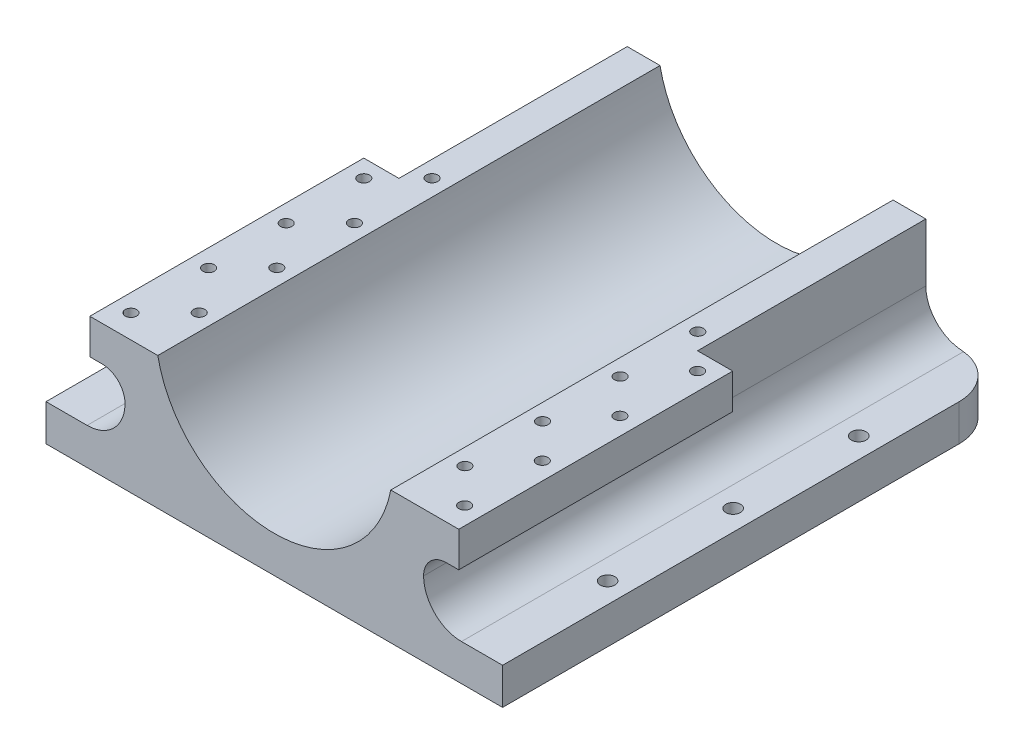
ISO-10303-21;
HEADER;
FILE_DESCRIPTION(('STEP AP214'),'2;1');
FILE_NAME('part.step','',(''),(''),'','','');
FILE_SCHEMA(('AUTOMOTIVE_DESIGN { 1 0 10303 214 1 1 1 1 }'));
ENDSEC;
DATA;
#1=APPLICATION_CONTEXT('core data for automotive mechanical design processes');
#2=APPLICATION_PROTOCOL_DEFINITION('international standard','automotive_design',2000,#1);
#3=PRODUCT_CONTEXT('',#1,'mechanical');
#4=PRODUCT('Part','Part','',(#3));
#5=PRODUCT_RELATED_PRODUCT_CATEGORY('part','',(#4));
#6=PRODUCT_DEFINITION_FORMATION('','',#4);
#7=PRODUCT_DEFINITION_CONTEXT('part definition',#1,'design');
#8=PRODUCT_DEFINITION('design','',#6,#7);
#9=PRODUCT_DEFINITION_SHAPE('','',#8);
#10=(LENGTH_UNIT() NAMED_UNIT(*) SI_UNIT(.MILLI.,.METRE.));
#11=(NAMED_UNIT(*) PLANE_ANGLE_UNIT() SI_UNIT($,.RADIAN.));
#12=(NAMED_UNIT(*) SI_UNIT($,.STERADIAN.) SOLID_ANGLE_UNIT());
#13=UNCERTAINTY_MEASURE_WITH_UNIT(LENGTH_MEASURE(1.E-05),#10,'distance_accuracy_value','');
#14=(GEOMETRIC_REPRESENTATION_CONTEXT(3) GLOBAL_UNCERTAINTY_ASSIGNED_CONTEXT((#13)) GLOBAL_UNIT_ASSIGNED_CONTEXT((#10,
#11,#12)) REPRESENTATION_CONTEXT('',''));
#15=CARTESIAN_POINT('',(0.,0.,0.));
#16=DIRECTION('',(0.,0.,1.));
#17=DIRECTION('',(1.,0.,0.));
#18=AXIS2_PLACEMENT_3D('',#15,#16,#17);
#19=CARTESIAN_POINT('',(45.5,-0.00100000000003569,82.5));
#20=DIRECTION('',(0.,1.,0.));
#21=DIRECTION('',(-1.,0.,0.));
#22=AXIS2_PLACEMENT_3D('',#19,#20,#21);
#23=CYLINDRICAL_SURFACE('',#22,1.6);
#24=CARTESIAN_POINT('',(45.5,8.,82.5));
#25=DIRECTION('',(0.,1.,0.));
#26=DIRECTION('',(-1.,0.,0.));
#27=AXIS2_PLACEMENT_3D('',#24,#25,#26);
#28=CIRCLE('',#27,1.6);
#29=CARTESIAN_POINT('',(43.9,8.,82.5));
#30=VERTEX_POINT('',#29);
#31=EDGE_CURVE('E726',#30,#30,#28,.T.);
#32=ORIENTED_EDGE('',*,*,#31,.T.);
#33=EDGE_LOOP('',(#32));
#34=FACE_BOUND('',#33,.T.);
#35=CARTESIAN_POINT('',(45.5,0.,82.5));
#36=DIRECTION('',(0.,1.,0.));
#37=DIRECTION('',(0.,0.,1.));
#38=AXIS2_PLACEMENT_3D('',#35,#36,#37);
#39=CIRCLE('',#38,1.6);
#40=CARTESIAN_POINT('',(45.5,0.,84.1));
#41=VERTEX_POINT('',#40);
#42=EDGE_CURVE('E729',#41,#41,#39,.F.);
#43=ORIENTED_EDGE('',*,*,#42,.T.);
#44=EDGE_LOOP('',(#43));
#45=FACE_BOUND('',#44,.T.);
#46=ADVANCED_FACE('F33',(#34,#45),#23,.F.);
#47=CARTESIAN_POINT('',(-36.55,19.,104.85));
#48=DIRECTION('',(0.,1.,0.));
#49=DIRECTION('',(0.,0.,1.));
#50=AXIS2_PLACEMENT_3D('',#47,#48,#49);
#51=CYLINDRICAL_SURFACE('',#50,1.25);
#52=CARTESIAN_POINT('',(-36.55,29.,104.85));
#53=DIRECTION('',(0.,-1.,0.));
#54=DIRECTION('',(0.,0.,1.));
#55=AXIS2_PLACEMENT_3D('',#52,#53,#54);
#56=CIRCLE('',#55,1.25);
#57=CARTESIAN_POINT('',(-36.55,29.,106.1));
#58=VERTEX_POINT('',#57);
#59=EDGE_CURVE('E404',#58,#58,#56,.T.);
#60=ORIENTED_EDGE('',*,*,#59,.F.);
#61=EDGE_LOOP('',(#60));
#62=FACE_BOUND('',#61,.T.);
#63=CARTESIAN_POINT('',(-36.55,21.2999999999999,104.85));
#64=DIRECTION('',(0.,1.,0.));
#65=DIRECTION('',(0.,0.,1.));
#66=AXIS2_PLACEMENT_3D('',#63,#64,#65);
#67=CIRCLE('',#66,1.25);
#68=CARTESIAN_POINT('',(-36.55,21.2999999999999,106.1));
#69=VERTEX_POINT('',#68);
#70=EDGE_CURVE('E408',#69,#69,#67,.F.);
#71=ORIENTED_EDGE('',*,*,#70,.T.);
#72=EDGE_LOOP('',(#71));
#73=FACE_BOUND('',#72,.T.);
#74=ADVANCED_FACE('F785',(#62,#73),#51,.F.);
#75=CARTESIAN_POINT('',(-36.55,19.,87.85));
#76=DIRECTION('',(0.,1.,0.));
#77=DIRECTION('',(0.,0.,1.));
#78=AXIS2_PLACEMENT_3D('',#75,#76,#77);
#79=CYLINDRICAL_SURFACE('',#78,1.25);
#80=CARTESIAN_POINT('',(-36.55,29.,87.85));
#81=DIRECTION('',(0.,-1.,0.));
#82=DIRECTION('',(0.,0.,1.));
#83=AXIS2_PLACEMENT_3D('',#80,#81,#82);
#84=CIRCLE('',#83,1.25);
#85=CARTESIAN_POINT('',(-36.55,29.,89.1));
#86=VERTEX_POINT('',#85);
#87=EDGE_CURVE('E412',#86,#86,#84,.T.);
#88=ORIENTED_EDGE('',*,*,#87,.F.);
#89=EDGE_LOOP('',(#88));
#90=FACE_BOUND('',#89,.T.);
#91=CARTESIAN_POINT('',(-36.55,21.2999999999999,87.85));
#92=DIRECTION('',(0.,1.,0.));
#93=DIRECTION('',(0.,0.,1.));
#94=AXIS2_PLACEMENT_3D('',#91,#92,#93);
#95=CIRCLE('',#94,1.25);
#96=CARTESIAN_POINT('',(-36.55,21.2999999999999,89.1));
#97=VERTEX_POINT('',#96);
#98=EDGE_CURVE('E419',#97,#97,#95,.F.);
#99=ORIENTED_EDGE('',*,*,#98,.T.);
#100=EDGE_LOOP('',(#99));
#101=FACE_BOUND('',#100,.T.);
#102=ADVANCED_FACE('F790',(#90,#101),#79,.F.);
#103=CARTESIAN_POINT('',(-36.55,19.,70.85));
#104=DIRECTION('',(0.,1.,0.));
#105=DIRECTION('',(0.,0.,1.));
#106=AXIS2_PLACEMENT_3D('',#103,#104,#105);
#107=CYLINDRICAL_SURFACE('',#106,1.25);
#108=CARTESIAN_POINT('',(-36.55,29.,70.85));
#109=DIRECTION('',(0.,-1.,0.));
#110=DIRECTION('',(0.,0.,1.));
#111=AXIS2_PLACEMENT_3D('',#108,#109,#110);
#112=CIRCLE('',#111,1.25);
#113=CARTESIAN_POINT('',(-36.55,29.,72.1));
#114=VERTEX_POINT('',#113);
#115=EDGE_CURVE('E409',#114,#114,#112,.T.);
#116=ORIENTED_EDGE('',*,*,#115,.F.);
#117=EDGE_LOOP('',(#116));
#118=FACE_BOUND('',#117,.T.);
#119=CARTESIAN_POINT('',(-36.55,21.2999999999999,70.85));
#120=DIRECTION('',(0.,1.,0.));
#121=DIRECTION('',(0.,0.,1.));
#122=AXIS2_PLACEMENT_3D('',#119,#120,#121);
#123=CIRCLE('',#122,1.25);
#124=CARTESIAN_POINT('',(-36.55,21.2999999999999,72.1));
#125=VERTEX_POINT('',#124);
#126=EDGE_CURVE('E422',#125,#125,#123,.F.);
#127=ORIENTED_EDGE('',*,*,#126,.T.);
#128=EDGE_LOOP('',(#127));
#129=FACE_BOUND('',#128,.T.);
#130=ADVANCED_FACE('F1512',(#118,#129),#107,.F.);
#131=CARTESIAN_POINT('',(-36.55,19.,53.85));
#132=DIRECTION('',(0.,1.,0.));
#133=DIRECTION('',(0.,0.,1.));
#134=AXIS2_PLACEMENT_3D('',#131,#132,#133);
#135=CYLINDRICAL_SURFACE('',#134,1.25);
#136=CARTESIAN_POINT('',(-36.55,29.,53.85));
#137=DIRECTION('',(0.,-1.,0.));
#138=DIRECTION('',(0.,0.,1.));
#139=AXIS2_PLACEMENT_3D('',#136,#137,#138);
#140=CIRCLE('',#139,1.25);
#141=CARTESIAN_POINT('',(-36.55,29.,55.1));
#142=VERTEX_POINT('',#141);
#143=EDGE_CURVE('E405',#142,#142,#140,.T.);
#144=ORIENTED_EDGE('',*,*,#143,.F.);
#145=EDGE_LOOP('',(#144));
#146=FACE_BOUND('',#145,.T.);
#147=CARTESIAN_POINT('',(-36.55,21.2999999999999,53.85));
#148=DIRECTION('',(0.,1.,0.));
#149=DIRECTION('',(0.,0.,1.));
#150=AXIS2_PLACEMENT_3D('',#147,#148,#149);
#151=CIRCLE('',#150,1.25);
#152=CARTESIAN_POINT('',(-36.55,21.2999999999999,55.1));
#153=VERTEX_POINT('',#152);
#154=EDGE_CURVE('E425',#153,#153,#151,.F.);
#155=ORIENTED_EDGE('',*,*,#154,.T.);
#156=EDGE_LOOP('',(#155));
#157=FACE_BOUND('',#156,.T.);
#158=ADVANCED_FACE('F761',(#146,#157),#135,.F.);
#159=CARTESIAN_POINT('',(-37.7,16.2999999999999,110.));
#160=DIRECTION('',(0.,0.,1.));
#161=DIRECTION('',(1.,0.,0.));
#162=AXIS2_PLACEMENT_3D('',#159,#160,#161);
#163=CYLINDRICAL_SURFACE('',#162,5.);
#164=DIRECTION('',(0.,0.,1.));
#165=VECTOR('',#164,1.);
#166=CARTESIAN_POINT('',(-33.45,18.9339134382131,110.));
#167=LINE('',#166,#165);
#168=CARTESIAN_POINT('',(-33.45,18.9339134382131,56.95));
#169=VERTEX_POINT('',#168);
#170=CARTESIAN_POINT('',(-33.45,18.9339134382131,50.75));
#171=VERTEX_POINT('',#170);
#172=EDGE_CURVE('E724',#169,#171,#167,.F.);
#173=ORIENTED_EDGE('',*,*,#172,.T.);
#174=CARTESIAN_POINT('',(-37.7,16.2999999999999,50.75));
#175=DIRECTION('',(0.,0.,-1.));
#176=DIRECTION('',(-1.,0.,0.));
#177=AXIS2_PLACEMENT_3D('',#174,#175,#176);
#178=CIRCLE('',#177,5.);
#179=CARTESIAN_POINT('',(-37.7,21.2999999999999,50.75));
#180=VERTEX_POINT('',#179);
#181=EDGE_CURVE('E319',#171,#180,#178,.F.);
#182=ORIENTED_EDGE('',*,*,#181,.T.);
#183=DIRECTION('',(0.,0.,-1.));
#184=VECTOR('',#183,1.);
#185=CARTESIAN_POINT('',(-37.7,21.2999999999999,110.));
#186=LINE('',#185,#184);
#187=CARTESIAN_POINT('',(-37.7,21.2999999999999,50.));
#188=VERTEX_POINT('',#187);
#189=EDGE_CURVE('E335',#188,#180,#186,.F.);
#190=ORIENTED_EDGE('',*,*,#189,.F.);
#191=CARTESIAN_POINT('',(-37.7,16.2999999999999,50.));
#192=DIRECTION('',(0.,0.,-1.));
#193=DIRECTION('',(-1.,0.,0.));
#194=AXIS2_PLACEMENT_3D('',#191,#192,#193);
#195=CIRCLE('',#194,5.);
#196=CARTESIAN_POINT('',(-32.7,16.3,50.));
#197=VERTEX_POINT('',#196);
#198=EDGE_CURVE('E680',#197,#188,#195,.F.);
#199=ORIENTED_EDGE('',*,*,#198,.F.);
#200=DIRECTION('',(0.,0.,-1.));
#201=VECTOR('',#200,1.);
#202=CARTESIAN_POINT('',(-32.7,16.3,110.));
#203=LINE('',#202,#201);
#204=CARTESIAN_POINT('',(-32.7,16.3,110.));
#205=VERTEX_POINT('',#204);
#206=EDGE_CURVE('E661',#205,#197,#203,.T.);
#207=ORIENTED_EDGE('',*,*,#206,.F.);
#208=CARTESIAN_POINT('',(-37.7,16.2999999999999,110.));
#209=DIRECTION('',(0.,0.,-1.));
#210=DIRECTION('',(-1.,0.,0.));
#211=AXIS2_PLACEMENT_3D('',#208,#209,#210);
#212=CIRCLE('',#211,5.);
#213=CARTESIAN_POINT('',(-37.7,21.2999999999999,110.));
#214=VERTEX_POINT('',#213);
#215=EDGE_CURVE('E684',#214,#205,#212,.T.);
#216=ORIENTED_EDGE('',*,*,#215,.F.);
#217=CARTESIAN_POINT('',(-37.7,21.2999999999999,107.95));
#218=VERTEX_POINT('',#217);
#219=EDGE_CURVE('E673',#218,#214,#186,.F.);
#220=ORIENTED_EDGE('',*,*,#219,.F.);
#221=CARTESIAN_POINT('',(-37.7,16.2999999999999,107.95));
#222=DIRECTION('',(0.,0.,1.));
#223=DIRECTION('',(1.,0.,0.));
#224=AXIS2_PLACEMENT_3D('',#221,#222,#223);
#225=CIRCLE('',#224,5.);
#226=CARTESIAN_POINT('',(-33.45,18.9339134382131,107.95));
#227=VERTEX_POINT('',#226);
#228=EDGE_CURVE('E323',#218,#227,#225,.F.);
#229=ORIENTED_EDGE('',*,*,#228,.T.);
#230=DIRECTION('',(0.,0.,1.));
#231=VECTOR('',#230,1.);
#232=CARTESIAN_POINT('',(-33.45,18.9339134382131,110.));
#233=LINE('',#232,#231);
#234=CARTESIAN_POINT('',(-33.45,18.9339134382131,101.75));
#235=VERTEX_POINT('',#234);
#236=EDGE_CURVE('E715',#227,#235,#233,.F.);
#237=ORIENTED_EDGE('',*,*,#236,.T.);
#238=CARTESIAN_POINT('',(-37.7,16.2999999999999,101.75));
#239=DIRECTION('',(0.,0.,-1.));
#240=DIRECTION('',(-1.,0.,0.));
#241=AXIS2_PLACEMENT_3D('',#238,#239,#240);
#242=CIRCLE('',#241,5.);
#243=CARTESIAN_POINT('',(-37.7,21.2999999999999,101.75));
#244=VERTEX_POINT('',#243);
#245=EDGE_CURVE('E385',#235,#244,#242,.F.);
#246=ORIENTED_EDGE('',*,*,#245,.T.);
#247=CARTESIAN_POINT('',(-37.7,21.2999999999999,90.95));
#248=VERTEX_POINT('',#247);
#249=EDGE_CURVE('E860',#248,#244,#186,.F.);
#250=ORIENTED_EDGE('',*,*,#249,.F.);
#251=CARTESIAN_POINT('',(-37.7,16.2999999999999,90.95));
#252=DIRECTION('',(0.,0.,1.));
#253=DIRECTION('',(1.,0.,0.));
#254=AXIS2_PLACEMENT_3D('',#251,#252,#253);
#255=CIRCLE('',#254,5.);
#256=CARTESIAN_POINT('',(-33.45,18.9339134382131,90.95));
#257=VERTEX_POINT('',#256);
#258=EDGE_CURVE('E388',#248,#257,#255,.F.);
#259=ORIENTED_EDGE('',*,*,#258,.T.);
#260=DIRECTION('',(0.,0.,1.));
#261=VECTOR('',#260,1.);
#262=CARTESIAN_POINT('',(-33.45,18.9339134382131,110.));
#263=LINE('',#262,#261);
#264=CARTESIAN_POINT('',(-33.45,18.9339134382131,84.75));
#265=VERTEX_POINT('',#264);
#266=EDGE_CURVE('E718',#257,#265,#263,.F.);
#267=ORIENTED_EDGE('',*,*,#266,.T.);
#268=CARTESIAN_POINT('',(-37.7,16.2999999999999,84.75));
#269=DIRECTION('',(0.,0.,-1.));
#270=DIRECTION('',(-1.,0.,0.));
#271=AXIS2_PLACEMENT_3D('',#268,#269,#270);
#272=CIRCLE('',#271,5.);
#273=CARTESIAN_POINT('',(-37.7,21.2999999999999,84.75));
#274=VERTEX_POINT('',#273);
#275=EDGE_CURVE('E391',#265,#274,#272,.F.);
#276=ORIENTED_EDGE('',*,*,#275,.T.);
#277=CARTESIAN_POINT('',(-37.7,21.2999999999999,73.95));
#278=VERTEX_POINT('',#277);
#279=EDGE_CURVE('E858',#278,#274,#186,.F.);
#280=ORIENTED_EDGE('',*,*,#279,.F.);
#281=CARTESIAN_POINT('',(-37.7,16.2999999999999,73.95));
#282=DIRECTION('',(0.,0.,1.));
#283=DIRECTION('',(1.,0.,0.));
#284=AXIS2_PLACEMENT_3D('',#281,#282,#283);
#285=CIRCLE('',#284,5.);
#286=CARTESIAN_POINT('',(-33.45,18.9339134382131,73.95));
#287=VERTEX_POINT('',#286);
#288=EDGE_CURVE('E394',#278,#287,#285,.F.);
#289=ORIENTED_EDGE('',*,*,#288,.T.);
#290=DIRECTION('',(0.,0.,1.));
#291=VECTOR('',#290,1.);
#292=CARTESIAN_POINT('',(-33.45,18.9339134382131,110.));
#293=LINE('',#292,#291);
#294=CARTESIAN_POINT('',(-33.45,18.9339134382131,67.75));
#295=VERTEX_POINT('',#294);
#296=EDGE_CURVE('E721',#287,#295,#293,.F.);
#297=ORIENTED_EDGE('',*,*,#296,.T.);
#298=CARTESIAN_POINT('',(-37.7,16.2999999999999,67.75));
#299=DIRECTION('',(0.,0.,-1.));
#300=DIRECTION('',(-1.,0.,0.));
#301=AXIS2_PLACEMENT_3D('',#298,#299,#300);
#302=CIRCLE('',#301,5.);
#303=CARTESIAN_POINT('',(-37.7,21.2999999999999,67.75));
#304=VERTEX_POINT('',#303);
#305=EDGE_CURVE('E397',#295,#304,#302,.F.);
#306=ORIENTED_EDGE('',*,*,#305,.T.);
#307=CARTESIAN_POINT('',(-37.7,21.2999999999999,56.95));
#308=VERTEX_POINT('',#307);
#309=EDGE_CURVE('E676',#308,#304,#186,.F.);
#310=ORIENTED_EDGE('',*,*,#309,.F.);
#311=CARTESIAN_POINT('',(-37.7,16.2999999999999,56.95));
#312=DIRECTION('',(0.,0.,1.));
#313=DIRECTION('',(1.,0.,0.));
#314=AXIS2_PLACEMENT_3D('',#311,#312,#313);
#315=CIRCLE('',#314,5.);
#316=EDGE_CURVE('E400',#308,#169,#315,.F.);
#317=ORIENTED_EDGE('',*,*,#316,.T.);
#318=EDGE_LOOP('',(#173,#182,#190,#199,#207,#216,#220,#229,#237,#246,#250,#259,#267,#276,#280,
#289,#297,#306,#310,#317));
#319=FACE_BOUND('',#318,.T.);
#320=ADVANCED_FACE('F757',(#319),#163,.F.);
#321=CARTESIAN_POINT('',(37.7,16.2999999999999,120.889444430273));
#322=DIRECTION('',(0.,0.,-1.));
#323=DIRECTION('',(-1.,0.,0.));
#324=AXIS2_PLACEMENT_3D('',#321,#322,#323);
#325=CYLINDRICAL_SURFACE('',#324,5.);
#326=CARTESIAN_POINT('',(37.7,16.2999999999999,73.95));
#327=DIRECTION('',(0.,0.,-1.));
#328=DIRECTION('',(-1.,0.,0.));
#329=AXIS2_PLACEMENT_3D('',#326,#327,#328);
#330=CIRCLE('',#329,5.);
#331=CARTESIAN_POINT('',(37.7,21.2999999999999,73.95));
#332=VERTEX_POINT('',#331);
#333=CARTESIAN_POINT('',(33.45,18.9339134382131,73.95));
#334=VERTEX_POINT('',#333);
#335=EDGE_CURVE('E501',#332,#334,#330,.F.);
#336=ORIENTED_EDGE('',*,*,#335,.F.);
#337=DIRECTION('',(0.,0.,-1.));
#338=VECTOR('',#337,1.);
#339=CARTESIAN_POINT('',(37.7,21.2999999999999,120.889444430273));
#340=LINE('',#339,#338);
#341=CARTESIAN_POINT('',(37.7,21.2999999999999,84.75));
#342=VERTEX_POINT('',#341);
#343=EDGE_CURVE('E682',#342,#332,#340,.T.);
#344=ORIENTED_EDGE('',*,*,#343,.F.);
#345=CARTESIAN_POINT('',(37.7,16.2999999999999,84.75));
#346=DIRECTION('',(0.,0.,1.));
#347=DIRECTION('',(1.,0.,0.));
#348=AXIS2_PLACEMENT_3D('',#345,#346,#347);
#349=CIRCLE('',#348,5.);
#350=CARTESIAN_POINT('',(33.45,18.9339134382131,84.75));
#351=VERTEX_POINT('',#350);
#352=EDGE_CURVE('E495',#351,#342,#349,.F.);
#353=ORIENTED_EDGE('',*,*,#352,.F.);
#354=DIRECTION('',(0.,0.,-1.));
#355=VECTOR('',#354,1.);
#356=CARTESIAN_POINT('',(33.45,18.9339134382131,120.889444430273));
#357=LINE('',#356,#355);
#358=CARTESIAN_POINT('',(33.45,18.9339134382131,90.95));
#359=VERTEX_POINT('',#358);
#360=EDGE_CURVE('E711',#359,#351,#357,.T.);
#361=ORIENTED_EDGE('',*,*,#360,.F.);
#362=CARTESIAN_POINT('',(37.7,16.2999999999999,90.95));
#363=DIRECTION('',(0.,0.,-1.));
#364=DIRECTION('',(-1.,0.,0.));
#365=AXIS2_PLACEMENT_3D('',#362,#363,#364);
#366=CIRCLE('',#365,5.);
#367=CARTESIAN_POINT('',(37.7,21.2999999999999,90.95));
#368=VERTEX_POINT('',#367);
#369=EDGE_CURVE('E497',#368,#359,#366,.F.);
#370=ORIENTED_EDGE('',*,*,#369,.F.);
#371=CARTESIAN_POINT('',(37.7,21.2999999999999,101.75));
#372=VERTEX_POINT('',#371);
#373=EDGE_CURVE('E681',#372,#368,#340,.T.);
#374=ORIENTED_EDGE('',*,*,#373,.F.);
#375=CARTESIAN_POINT('',(37.7,16.2999999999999,101.75));
#376=DIRECTION('',(0.,0.,1.));
#377=DIRECTION('',(1.,0.,0.));
#378=AXIS2_PLACEMENT_3D('',#375,#376,#377);
#379=CIRCLE('',#378,5.);
#380=CARTESIAN_POINT('',(33.45,18.9339134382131,101.75));
#381=VERTEX_POINT('',#380);
#382=EDGE_CURVE('E467',#381,#372,#379,.F.);
#383=ORIENTED_EDGE('',*,*,#382,.F.);
#384=DIRECTION('',(0.,0.,-1.));
#385=VECTOR('',#384,1.);
#386=CARTESIAN_POINT('',(33.45,18.9339134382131,120.889444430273));
#387=LINE('',#386,#385);
#388=CARTESIAN_POINT('',(33.45,18.9339134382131,107.95));
#389=VERTEX_POINT('',#388);
#390=EDGE_CURVE('E709',#389,#381,#387,.T.);
#391=ORIENTED_EDGE('',*,*,#390,.F.);
#392=CARTESIAN_POINT('',(37.7,16.2999999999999,107.95));
#393=DIRECTION('',(0.,0.,-1.));
#394=DIRECTION('',(-1.,0.,0.));
#395=AXIS2_PLACEMENT_3D('',#392,#393,#394);
#396=CIRCLE('',#395,5.);
#397=CARTESIAN_POINT('',(37.7,21.2999999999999,107.95));
#398=VERTEX_POINT('',#397);
#399=EDGE_CURVE('E493',#398,#389,#396,.F.);
#400=ORIENTED_EDGE('',*,*,#399,.F.);
#401=CARTESIAN_POINT('',(37.7,21.2999999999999,110.));
#402=VERTEX_POINT('',#401);
#403=EDGE_CURVE('E677',#402,#398,#340,.T.);
#404=ORIENTED_EDGE('',*,*,#403,.F.);
#405=CARTESIAN_POINT('',(37.7,16.2999999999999,110.));
#406=DIRECTION('',(0.,0.,-1.));
#407=DIRECTION('',(-1.,0.,0.));
#408=AXIS2_PLACEMENT_3D('',#405,#406,#407);
#409=CIRCLE('',#408,5.);
#410=CARTESIAN_POINT('',(32.7,16.3,110.));
#411=VERTEX_POINT('',#410);
#412=EDGE_CURVE('E689',#411,#402,#409,.T.);
#413=ORIENTED_EDGE('',*,*,#412,.F.);
#414=DIRECTION('',(0.,0.,-1.));
#415=VECTOR('',#414,1.);
#416=CARTESIAN_POINT('',(32.7,16.3,110.));
#417=LINE('',#416,#415);
#418=CARTESIAN_POINT('',(32.7,16.3,50.));
#419=VERTEX_POINT('',#418);
#420=EDGE_CURVE('E665',#411,#419,#417,.T.);
#421=ORIENTED_EDGE('',*,*,#420,.T.);
#422=CARTESIAN_POINT('',(37.7,16.2999999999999,50.));
#423=DIRECTION('',(0.,0.,-1.));
#424=DIRECTION('',(-1.,0.,0.));
#425=AXIS2_PLACEMENT_3D('',#422,#423,#424);
#426=CIRCLE('',#425,5.);
#427=CARTESIAN_POINT('',(37.7,21.2999999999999,50.));
#428=VERTEX_POINT('',#427);
#429=EDGE_CURVE('E686',#428,#419,#426,.F.);
#430=ORIENTED_EDGE('',*,*,#429,.F.);
#431=CARTESIAN_POINT('',(37.7,21.2999999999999,50.75));
#432=VERTEX_POINT('',#431);
#433=EDGE_CURVE('E675',#432,#428,#340,.T.);
#434=ORIENTED_EDGE('',*,*,#433,.F.);
#435=CARTESIAN_POINT('',(37.7,16.2999999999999,50.75));
#436=DIRECTION('',(0.,0.,1.));
#437=DIRECTION('',(1.,0.,0.));
#438=AXIS2_PLACEMENT_3D('',#435,#436,#437);
#439=CIRCLE('',#438,5.);
#440=CARTESIAN_POINT('',(33.45,18.9339134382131,50.75));
#441=VERTEX_POINT('',#440);
#442=EDGE_CURVE('E691',#441,#432,#439,.F.);
#443=ORIENTED_EDGE('',*,*,#442,.F.);
#444=DIRECTION('',(0.,0.,-1.));
#445=VECTOR('',#444,1.);
#446=CARTESIAN_POINT('',(33.45,18.9339134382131,120.889444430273));
#447=LINE('',#446,#445);
#448=CARTESIAN_POINT('',(33.45,18.9339134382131,56.95));
#449=VERTEX_POINT('',#448);
#450=EDGE_CURVE('E693',#449,#441,#447,.T.);
#451=ORIENTED_EDGE('',*,*,#450,.F.);
#452=CARTESIAN_POINT('',(37.7,16.2999999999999,56.95));
#453=DIRECTION('',(0.,0.,-1.));
#454=DIRECTION('',(-1.,0.,0.));
#455=AXIS2_PLACEMENT_3D('',#452,#453,#454);
#456=CIRCLE('',#455,5.);
#457=CARTESIAN_POINT('',(37.7,21.2999999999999,56.95));
#458=VERTEX_POINT('',#457);
#459=EDGE_CURVE('E695',#458,#449,#456,.F.);
#460=ORIENTED_EDGE('',*,*,#459,.F.);
#461=CARTESIAN_POINT('',(37.7,21.2999999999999,67.75));
#462=VERTEX_POINT('',#461);
#463=EDGE_CURVE('E964',#462,#458,#340,.T.);
#464=ORIENTED_EDGE('',*,*,#463,.F.);
#465=CARTESIAN_POINT('',(37.7,16.2999999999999,67.75));
#466=DIRECTION('',(0.,0.,1.));
#467=DIRECTION('',(1.,0.,0.));
#468=AXIS2_PLACEMENT_3D('',#465,#466,#467);
#469=CIRCLE('',#468,5.);
#470=CARTESIAN_POINT('',(33.45,18.9339134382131,67.75));
#471=VERTEX_POINT('',#470);
#472=EDGE_CURVE('E499',#471,#462,#469,.F.);
#473=ORIENTED_EDGE('',*,*,#472,.F.);
#474=DIRECTION('',(0.,0.,-1.));
#475=VECTOR('',#474,1.);
#476=CARTESIAN_POINT('',(33.45,18.9339134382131,120.889444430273));
#477=LINE('',#476,#475);
#478=EDGE_CURVE('E713',#334,#471,#477,.T.);
#479=ORIENTED_EDGE('',*,*,#478,.F.);
#480=EDGE_LOOP('',(#336,#344,#353,#361,#370,#374,#383,#391,#400,#404,#413,#421,#430,#434,#443,
#451,#460,#464,#473,#479));
#481=FACE_BOUND('',#480,.T.);
#482=ADVANCED_FACE('F760',(#481),#325,.F.);
#483=CARTESIAN_POINT('',(36.55,19.,104.85));
#484=DIRECTION('',(0.,1.,0.));
#485=DIRECTION('',(0.,0.,1.));
#486=AXIS2_PLACEMENT_3D('',#483,#484,#485);
#487=CYLINDRICAL_SURFACE('',#486,1.25);
#488=CARTESIAN_POINT('',(36.55,29.,104.85));
#489=DIRECTION('',(0.,1.,0.));
#490=DIRECTION('',(0.,0.,1.));
#491=AXIS2_PLACEMENT_3D('',#488,#489,#490);
#492=CIRCLE('',#491,1.25);
#493=CARTESIAN_POINT('',(36.55,29.,106.1));
#494=VERTEX_POINT('',#493);
#495=EDGE_CURVE('E503',#494,#494,#492,.T.);
#496=ORIENTED_EDGE('',*,*,#495,.T.);
#497=EDGE_LOOP('',(#496));
#498=FACE_BOUND('',#497,.T.);
#499=CARTESIAN_POINT('',(36.55,21.2999999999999,104.85));
#500=DIRECTION('',(0.,-1.,0.));
#501=DIRECTION('',(0.,0.,-1.));
#502=AXIS2_PLACEMENT_3D('',#499,#500,#501);
#503=CIRCLE('',#502,1.25);
#504=CARTESIAN_POINT('',(36.55,21.2999999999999,103.6));
#505=VERTEX_POINT('',#504);
#506=EDGE_CURVE('E507',#505,#505,#503,.T.);
#507=ORIENTED_EDGE('',*,*,#506,.T.);
#508=EDGE_LOOP('',(#507));
#509=FACE_BOUND('',#508,.T.);
#510=ADVANCED_FACE('F765',(#498,#509),#487,.F.);
#511=CARTESIAN_POINT('',(36.55,19.,87.85));
#512=DIRECTION('',(0.,1.,0.));
#513=DIRECTION('',(0.,0.,1.));
#514=AXIS2_PLACEMENT_3D('',#511,#512,#513);
#515=CYLINDRICAL_SURFACE('',#514,1.25);
#516=CARTESIAN_POINT('',(36.55,29.,87.85));
#517=DIRECTION('',(0.,1.,0.));
#518=DIRECTION('',(0.,0.,1.));
#519=AXIS2_PLACEMENT_3D('',#516,#517,#518);
#520=CIRCLE('',#519,1.25);
#521=CARTESIAN_POINT('',(36.55,29.,89.1));
#522=VERTEX_POINT('',#521);
#523=EDGE_CURVE('E508',#522,#522,#520,.T.);
#524=ORIENTED_EDGE('',*,*,#523,.T.);
#525=EDGE_LOOP('',(#524));
#526=FACE_BOUND('',#525,.T.);
#527=CARTESIAN_POINT('',(36.55,21.2999999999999,87.85));
#528=DIRECTION('',(0.,-1.,0.));
#529=DIRECTION('',(0.,0.,-1.));
#530=AXIS2_PLACEMENT_3D('',#527,#528,#529);
#531=CIRCLE('',#530,1.25);
#532=CARTESIAN_POINT('',(36.55,21.2999999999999,86.6));
#533=VERTEX_POINT('',#532);
#534=EDGE_CURVE('E515',#533,#533,#531,.T.);
#535=ORIENTED_EDGE('',*,*,#534,.T.);
#536=EDGE_LOOP('',(#535));
#537=FACE_BOUND('',#536,.T.);
#538=ADVANCED_FACE('F1542',(#526,#537),#515,.F.);
#539=CARTESIAN_POINT('',(36.55,19.,70.85));
#540=DIRECTION('',(0.,1.,0.));
#541=DIRECTION('',(0.,0.,1.));
#542=AXIS2_PLACEMENT_3D('',#539,#540,#541);
#543=CYLINDRICAL_SURFACE('',#542,1.25);
#544=CARTESIAN_POINT('',(36.55,29.,70.85));
#545=DIRECTION('',(0.,1.,0.));
#546=DIRECTION('',(0.,0.,1.));
#547=AXIS2_PLACEMENT_3D('',#544,#545,#546);
#548=CIRCLE('',#547,1.25);
#549=CARTESIAN_POINT('',(36.55,29.,72.1));
#550=VERTEX_POINT('',#549);
#551=EDGE_CURVE('E504',#550,#550,#548,.T.);
#552=ORIENTED_EDGE('',*,*,#551,.T.);
#553=EDGE_LOOP('',(#552));
#554=FACE_BOUND('',#553,.T.);
#555=CARTESIAN_POINT('',(36.55,21.2999999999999,70.85));
#556=DIRECTION('',(0.,-1.,0.));
#557=DIRECTION('',(0.,0.,-1.));
#558=AXIS2_PLACEMENT_3D('',#555,#556,#557);
#559=CIRCLE('',#558,1.25);
#560=CARTESIAN_POINT('',(36.55,21.2999999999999,69.6));
#561=VERTEX_POINT('',#560);
#562=EDGE_CURVE('E518',#561,#561,#559,.T.);
#563=ORIENTED_EDGE('',*,*,#562,.T.);
#564=EDGE_LOOP('',(#563));
#565=FACE_BOUND('',#564,.T.);
#566=ADVANCED_FACE('F782',(#554,#565),#543,.F.);
#567=CARTESIAN_POINT('',(0.,9.00000000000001,51.));
#568=DIRECTION('',(0.,1.,0.));
#569=DIRECTION('',(0.,0.,1.));
#570=AXIS2_PLACEMENT_3D('',#567,#568,#569);
#571=PLANE('',#570);
#572=CARTESIAN_POINT('',(29.1,9.00000000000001,97.35));
#573=DIRECTION('',(0.,1.,0.));
#574=DIRECTION('',(0.,0.,1.));
#575=AXIS2_PLACEMENT_3D('',#572,#573,#574);
#576=CIRCLE('',#575,1.25);
#577=CARTESIAN_POINT('',(29.1,9.00000000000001,98.6));
#578=VERTEX_POINT('',#577);
#579=EDGE_CURVE('E706',#578,#578,#576,.T.);
#580=ORIENTED_EDGE('',*,*,#579,.T.);
#581=EDGE_LOOP('',(#580));
#582=FACE_BOUND('',#581,.T.);
#583=ADVANCED_FACE('F779',(#582),#571,.T.);
#584=CARTESIAN_POINT('',(29.1,9.00000000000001,97.35));
#585=DIRECTION('',(0.,1.,0.));
#586=DIRECTION('',(0.,0.,1.));
#587=AXIS2_PLACEMENT_3D('',#584,#585,#586);
#588=CYLINDRICAL_SURFACE('',#587,1.25);
#589=ORIENTED_EDGE('',*,*,#579,.F.);
#590=EDGE_LOOP('',(#589));
#591=FACE_BOUND('',#590,.T.);
#592=CARTESIAN_POINT('',(29.1,29.,97.35));
#593=DIRECTION('',(0.,1.,0.));
#594=DIRECTION('',(0.,0.,1.));
#595=AXIS2_PLACEMENT_3D('',#592,#593,#594);
#596=CIRCLE('',#595,1.25);
#597=CARTESIAN_POINT('',(29.1,29.,98.6));
#598=VERTEX_POINT('',#597);
#599=EDGE_CURVE('E703',#598,#598,#596,.T.);
#600=ORIENTED_EDGE('',*,*,#599,.T.);
#601=EDGE_LOOP('',(#600));
#602=FACE_BOUND('',#601,.T.);
#603=ADVANCED_FACE('F775',(#591,#602),#588,.F.);
#604=CARTESIAN_POINT('',(0.,9.00000000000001,34.));
#605=DIRECTION('',(0.,1.,0.));
#606=DIRECTION('',(0.,0.,1.));
#607=AXIS2_PLACEMENT_3D('',#604,#605,#606);
#608=PLANE('',#607);
#609=CARTESIAN_POINT('',(29.1,9.00000000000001,80.35));
#610=DIRECTION('',(0.,1.,0.));
#611=DIRECTION('',(0.,0.,1.));
#612=AXIS2_PLACEMENT_3D('',#609,#610,#611);
#613=CIRCLE('',#612,1.25);
#614=CARTESIAN_POINT('',(29.1,9.00000000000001,81.6));
#615=VERTEX_POINT('',#614);
#616=EDGE_CURVE('E700',#615,#615,#613,.T.);
#617=ORIENTED_EDGE('',*,*,#616,.T.);
#618=EDGE_LOOP('',(#617));
#619=FACE_BOUND('',#618,.T.);
#620=ADVANCED_FACE('F771',(#619),#608,.T.);
#621=CARTESIAN_POINT('',(29.1,9.00000000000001,80.35));
#622=DIRECTION('',(0.,1.,0.));
#623=DIRECTION('',(0.,0.,1.));
#624=AXIS2_PLACEMENT_3D('',#621,#622,#623);
#625=CYLINDRICAL_SURFACE('',#624,1.25);
#626=ORIENTED_EDGE('',*,*,#616,.F.);
#627=EDGE_LOOP('',(#626));
#628=FACE_BOUND('',#627,.T.);
#629=CARTESIAN_POINT('',(29.1,29.,80.35));
#630=DIRECTION('',(0.,1.,0.));
#631=DIRECTION('',(0.,0.,1.));
#632=AXIS2_PLACEMENT_3D('',#629,#630,#631);
#633=CIRCLE('',#632,1.25);
#634=CARTESIAN_POINT('',(29.1,29.,81.6));
#635=VERTEX_POINT('',#634);
#636=EDGE_CURVE('E697',#635,#635,#633,.T.);
#637=ORIENTED_EDGE('',*,*,#636,.T.);
#638=EDGE_LOOP('',(#637));
#639=FACE_BOUND('',#638,.T.);
#640=ADVANCED_FACE('F767',(#628,#639),#625,.F.);
#641=CARTESIAN_POINT('',(36.55,19.,53.85));
#642=DIRECTION('',(0.,1.,0.));
#643=DIRECTION('',(0.,0.,1.));
#644=AXIS2_PLACEMENT_3D('',#641,#642,#643);
#645=CYLINDRICAL_SURFACE('',#644,1.25);
#646=CARTESIAN_POINT('',(36.55,29.,53.85));
#647=DIRECTION('',(0.,1.,0.));
#648=DIRECTION('',(0.,0.,1.));
#649=AXIS2_PLACEMENT_3D('',#646,#647,#648);
#650=CIRCLE('',#649,1.25);
#651=CARTESIAN_POINT('',(36.55,29.,55.1));
#652=VERTEX_POINT('',#651);
#653=EDGE_CURVE('E540',#652,#652,#650,.T.);
#654=ORIENTED_EDGE('',*,*,#653,.T.);
#655=EDGE_LOOP('',(#654));
#656=FACE_BOUND('',#655,.T.);
#657=CARTESIAN_POINT('',(36.55,21.2999999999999,53.85));
#658=DIRECTION('',(0.,-1.,0.));
#659=DIRECTION('',(0.,0.,-1.));
#660=AXIS2_PLACEMENT_3D('',#657,#658,#659);
#661=CIRCLE('',#660,1.25);
#662=CARTESIAN_POINT('',(36.55,21.2999999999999,52.6));
#663=VERTEX_POINT('',#662);
#664=EDGE_CURVE('E543',#663,#663,#661,.T.);
#665=ORIENTED_EDGE('',*,*,#664,.T.);
#666=EDGE_LOOP('',(#665));
#667=FACE_BOUND('',#666,.T.);
#668=ADVANCED_FACE('F770',(#656,#667),#645,.F.);
#669=CARTESIAN_POINT('',(-32.7,16.3,110.));
#670=DIRECTION('',(1.,0.,0.));
#671=DIRECTION('',(0.,0.,-1.));
#672=AXIS2_PLACEMENT_3D('',#669,#670,#671);
#673=PLANE('',#672);
#674=CARTESIAN_POINT('',(-32.7,16.3,0.));
#675=VERTEX_POINT('',#674);
#676=EDGE_CURVE('E660',#197,#675,#203,.T.);
#677=ORIENTED_EDGE('',*,*,#676,.F.);
#678=DIRECTION('',(0.,1.,0.));
#679=VECTOR('',#678,1.);
#680=CARTESIAN_POINT('',(-32.7,21.2999999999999,50.));
#681=LINE('',#680,#679);
#682=CARTESIAN_POINT('',(-32.7,29.,50.));
#683=VERTEX_POINT('',#682);
#684=EDGE_CURVE('E567',#197,#683,#681,.T.);
#685=ORIENTED_EDGE('',*,*,#684,.T.);
#686=DIRECTION('',(0.,0.,-1.));
#687=VECTOR('',#686,1.);
#688=CARTESIAN_POINT('',(-32.7,29.,110.));
#689=LINE('',#688,#687);
#690=CARTESIAN_POINT('',(-32.7,29.,0.));
#691=VERTEX_POINT('',#690);
#692=EDGE_CURVE('E558',#683,#691,#689,.T.);
#693=ORIENTED_EDGE('',*,*,#692,.T.);
#694=DIRECTION('',(0.,-1.,0.));
#695=VECTOR('',#694,1.);
#696=CARTESIAN_POINT('',(-32.7,16.3,0.));
#697=LINE('',#696,#695);
#698=EDGE_CURVE('E639',#691,#675,#697,.T.);
#699=ORIENTED_EDGE('',*,*,#698,.T.);
#700=EDGE_LOOP('',(#677,#685,#693,#699));
#701=FACE_BOUND('',#700,.T.);
#702=ADVANCED_FACE('F755',(#701),#673,.F.);
#703=CARTESIAN_POINT('',(50.,0.,110.));
#704=DIRECTION('',(-1.,0.,0.));
#705=DIRECTION('',(0.,0.,1.));
#706=AXIS2_PLACEMENT_3D('',#703,#704,#705);
#707=PLANE('',#706);
#708=DIRECTION('',(0.,0.,-1.));
#709=VECTOR('',#708,1.);
#710=CARTESIAN_POINT('',(50.,0.,110.));
#711=LINE('',#710,#709);
#712=CARTESIAN_POINT('',(50.,0.,110.));
#713=VERTEX_POINT('',#712);
#714=CARTESIAN_POINT('',(50.,0.,9.99999999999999));
#715=VERTEX_POINT('',#714);
#716=EDGE_CURVE('E631',#713,#715,#711,.T.);
#717=ORIENTED_EDGE('',*,*,#716,.T.);
#718=DIRECTION('',(0.,1.,0.));
#719=VECTOR('',#718,1.);
#720=CARTESIAN_POINT('',(50.,8.,9.99999999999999));
#721=LINE('',#720,#719);
#722=CARTESIAN_POINT('',(50.,8.,9.99999999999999));
#723=VERTEX_POINT('',#722);
#724=EDGE_CURVE('E732',#715,#723,#721,.T.);
#725=ORIENTED_EDGE('',*,*,#724,.T.);
#726=DIRECTION('',(0.,0.,-1.));
#727=VECTOR('',#726,1.);
#728=CARTESIAN_POINT('',(50.,8.,110.));
#729=LINE('',#728,#727);
#730=CARTESIAN_POINT('',(50.,8.,110.));
#731=VERTEX_POINT('',#730);
#732=EDGE_CURVE('E670',#731,#723,#729,.T.);
#733=ORIENTED_EDGE('',*,*,#732,.F.);
#734=DIRECTION('',(0.,1.,0.));
#735=VECTOR('',#734,1.);
#736=CARTESIAN_POINT('',(50.,0.,110.));
#737=LINE('',#736,#735);
#738=EDGE_CURVE('E612',#713,#731,#737,.T.);
#739=ORIENTED_EDGE('',*,*,#738,.F.);
#740=EDGE_LOOP('',(#717,#725,#733,#739));
#741=FACE_BOUND('',#740,.T.);
#742=ADVANCED_FACE('F751',(#741),#707,.F.);
#743=CARTESIAN_POINT('',(50.,8.,110.));
#744=DIRECTION('',(0.,-1.,0.));
#745=DIRECTION('',(1.,0.,0.));
#746=AXIS2_PLACEMENT_3D('',#743,#744,#745);
#747=PLANE('',#746);
#748=CARTESIAN_POINT('',(45.5,8.,55.));
#749=DIRECTION('',(0.,1.,0.));
#750=DIRECTION('',(-1.,0.,0.));
#751=AXIS2_PLACEMENT_3D('',#748,#749,#750);
#752=CIRCLE('',#751,1.6);
#753=CARTESIAN_POINT('',(43.9,8.,55.));
#754=VERTEX_POINT('',#753);
#755=EDGE_CURVE('E1704',#754,#754,#752,.T.);
#756=ORIENTED_EDGE('',*,*,#755,.F.);
#757=EDGE_LOOP('',(#756));
#758=FACE_BOUND('',#757,.T.);
#759=CARTESIAN_POINT('',(45.5,8.,27.5));
#760=DIRECTION('',(0.,1.,0.));
#761=DIRECTION('',(-1.,0.,0.));
#762=AXIS2_PLACEMENT_3D('',#759,#760,#761);
#763=CIRCLE('',#762,1.6);
#764=CARTESIAN_POINT('',(43.9,8.,27.5));
#765=VERTEX_POINT('',#764);
#766=EDGE_CURVE('E1723',#765,#765,#763,.T.);
#767=ORIENTED_EDGE('',*,*,#766,.F.);
#768=EDGE_LOOP('',(#767));
#769=FACE_BOUND('',#768,.T.);
#770=ORIENTED_EDGE('',*,*,#732,.T.);
#771=CARTESIAN_POINT('',(40.,8.,9.99999999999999));
#772=DIRECTION('',(0.,-1.,0.));
#773=DIRECTION('',(1.,0.,0.));
#774=AXIS2_PLACEMENT_3D('',#771,#772,#773);
#775=CIRCLE('',#774,10.);
#776=CARTESIAN_POINT('',(41.,8.,0.0501256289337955));
#777=VERTEX_POINT('',#776);
#778=EDGE_CURVE('E735',#723,#777,#775,.F.);
#779=ORIENTED_EDGE('',*,*,#778,.T.);
#780=DIRECTION('',(0.,0.,-1.));
#781=VECTOR('',#780,1.);
#782=CARTESIAN_POINT('',(41.,8.,110.));
#783=LINE('',#782,#781);
#784=CARTESIAN_POINT('',(41.,8.,110.));
#785=VERTEX_POINT('',#784);
#786=EDGE_CURVE('E668',#785,#777,#783,.T.);
#787=ORIENTED_EDGE('',*,*,#786,.F.);
#788=DIRECTION('',(-1.,0.,0.));
#789=VECTOR('',#788,1.);
#790=CARTESIAN_POINT('',(50.,8.,110.));
#791=LINE('',#790,#789);
#792=EDGE_CURVE('E615',#731,#785,#791,.T.);
#793=ORIENTED_EDGE('',*,*,#792,.F.);
#794=EDGE_LOOP('',(#770,#779,#787,#793));
#795=FACE_BOUND('',#794,.T.);
#796=ORIENTED_EDGE('',*,*,#31,.F.);
#797=EDGE_LOOP('',(#796));
#798=FACE_BOUND('',#797,.T.);
#799=ADVANCED_FACE('F747',(#758,#769,#795,#798),#747,.F.);
#800=CARTESIAN_POINT('',(41.,16.3,110.));
#801=DIRECTION('',(0.,0.,-1.));
#802=DIRECTION('',(-1.,0.,0.));
#803=AXIS2_PLACEMENT_3D('',#800,#801,#802);
#804=CYLINDRICAL_SURFACE('',#803,8.3);
#805=ORIENTED_EDGE('',*,*,#786,.T.);
#806=CARTESIAN_POINT('',(41.,8.,0.0501256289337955));
#807=CARTESIAN_POINT('',(40.8331431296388,7.99998390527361,0.0333918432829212));
#808=CARTESIAN_POINT('',(40.6663813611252,8.00501428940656,0.0208478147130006));
#809=CARTESIAN_POINT('',(40.3330480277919,8.02516801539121,0.00413927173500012));
#810=CARTESIAN_POINT('',(40.1664764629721,8.04029135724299,-2.52426730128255E-05));
#811=CARTESIAN_POINT('',(40.,8.06046117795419,0.));
#812=B_SPLINE_CURVE_WITH_KNOTS('',3,(#806,#807,#808,#809,#810,#811),.UNSPECIFIED.,.F.,.F.,(4,2,
4),(0.,0.501925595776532,1.00385119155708),.UNSPECIFIED.);
#813=CARTESIAN_POINT('',(40.,8.06046117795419,0.));
#814=VERTEX_POINT('',#813);
#815=EDGE_CURVE('E56',#777,#814,#812,.T.);
#816=ORIENTED_EDGE('',*,*,#815,.T.);
#817=CARTESIAN_POINT('',(41.,16.3,0.));
#818=DIRECTION('',(0.,0.,-1.));
#819=DIRECTION('',(-1.,0.,0.));
#820=AXIS2_PLACEMENT_3D('',#817,#818,#819);
#821=CIRCLE('',#820,8.3);
#822=CARTESIAN_POINT('',(32.7,16.3,0.));
#823=VERTEX_POINT('',#822);
#824=EDGE_CURVE('E611',#814,#823,#821,.T.);
#825=ORIENTED_EDGE('',*,*,#824,.T.);
#826=EDGE_CURVE('E664',#419,#823,#417,.T.);
#827=ORIENTED_EDGE('',*,*,#826,.F.);
#828=ORIENTED_EDGE('',*,*,#420,.F.);
#829=CARTESIAN_POINT('',(41.,16.3,110.));
#830=DIRECTION('',(0.,0.,-1.));
#831=DIRECTION('',(-1.,0.,0.));
#832=AXIS2_PLACEMENT_3D('',#829,#830,#831);
#833=CIRCLE('',#832,8.3);
#834=EDGE_CURVE('E618',#785,#411,#833,.T.);
#835=ORIENTED_EDGE('',*,*,#834,.F.);
#836=EDGE_LOOP('',(#805,#816,#825,#827,#828,#835));
#837=FACE_BOUND('',#836,.T.);
#838=ADVANCED_FACE('F741',(#837),#804,.F.);
#839=CARTESIAN_POINT('',(32.7,16.3,110.));
#840=DIRECTION('',(-1.,0.,0.));
#841=DIRECTION('',(0.,0.,1.));
#842=AXIS2_PLACEMENT_3D('',#839,#840,#841);
#843=PLANE('',#842);
#844=DIRECTION('',(0.,1.,0.));
#845=VECTOR('',#844,1.);
#846=CARTESIAN_POINT('',(32.7,21.2999999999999,50.));
#847=LINE('',#846,#845);
#848=CARTESIAN_POINT('',(32.7,29.,50.));
#849=VERTEX_POINT('',#848);
#850=EDGE_CURVE('E574',#419,#849,#847,.T.);
#851=ORIENTED_EDGE('',*,*,#850,.F.);
#852=ORIENTED_EDGE('',*,*,#826,.T.);
#853=DIRECTION('',(0.,1.,0.));
#854=VECTOR('',#853,1.);
#855=CARTESIAN_POINT('',(32.7,16.3,0.));
#856=LINE('',#855,#854);
#857=CARTESIAN_POINT('',(32.7,29.,0.));
#858=VERTEX_POINT('',#857);
#859=EDGE_CURVE('E633',#823,#858,#856,.T.);
#860=ORIENTED_EDGE('',*,*,#859,.T.);
#861=DIRECTION('',(0.,0.,-1.));
#862=VECTOR('',#861,1.);
#863=CARTESIAN_POINT('',(32.7,29.,110.));
#864=LINE('',#863,#862);
#865=EDGE_CURVE('E550',#849,#858,#864,.T.);
#866=ORIENTED_EDGE('',*,*,#865,.F.);
#867=EDGE_LOOP('',(#851,#852,#860,#866));
#868=FACE_BOUND('',#867,.T.);
#869=ADVANCED_FACE('F746',(#868),#843,.F.);
#870=CARTESIAN_POINT('',(0.,34.,110.));
#871=DIRECTION('',(0.,0.,-1.));
#872=DIRECTION('',(-1.,0.,0.));
#873=AXIS2_PLACEMENT_3D('',#870,#871,#872);
#874=CYLINDRICAL_SURFACE('',#873,26.);
#875=CARTESIAN_POINT('',(0.,34.,0.));
#876=DIRECTION('',(0.,0.,-1.));
#877=DIRECTION('',(1.,0.,0.));
#878=AXIS2_PLACEMENT_3D('',#875,#876,#877);
#879=CIRCLE('',#878,26.);
#880=CARTESIAN_POINT('',(25.5147016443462,29.,0.));
#881=VERTEX_POINT('',#880);
#882=CARTESIAN_POINT('',(-25.5147016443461,29.,0.));
#883=VERTEX_POINT('',#882);
#884=EDGE_CURVE('E636',#881,#883,#879,.T.);
#885=ORIENTED_EDGE('',*,*,#884,.T.);
#886=DIRECTION('',(0.,0.,-1.));
#887=VECTOR('',#886,1.);
#888=CARTESIAN_POINT('',(-25.5147016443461,29.,110.));
#889=LINE('',#888,#887);
#890=CARTESIAN_POINT('',(-25.5147016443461,29.,110.));
#891=VERTEX_POINT('',#890);
#892=EDGE_CURVE('E564',#883,#891,#889,.F.);
#893=ORIENTED_EDGE('',*,*,#892,.T.);
#894=CARTESIAN_POINT('',(0.,34.,110.));
#895=DIRECTION('',(0.,0.,-1.));
#896=DIRECTION('',(1.,0.,0.));
#897=AXIS2_PLACEMENT_3D('',#894,#895,#896);
#898=CIRCLE('',#897,26.);
#899=CARTESIAN_POINT('',(25.5147016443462,29.,110.));
#900=VERTEX_POINT('',#899);
#901=EDGE_CURVE('E620',#900,#891,#898,.T.);
#902=ORIENTED_EDGE('',*,*,#901,.F.);
#903=DIRECTION('',(0.,0.,-1.));
#904=VECTOR('',#903,1.);
#905=CARTESIAN_POINT('',(25.5147016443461,29.,110.));
#906=LINE('',#905,#904);
#907=EDGE_CURVE('E561',#900,#881,#906,.T.);
#908=ORIENTED_EDGE('',*,*,#907,.T.);
#909=EDGE_LOOP('',(#885,#893,#902,#908));
#910=FACE_BOUND('',#909,.T.);
#911=ADVANCED_FACE('F824',(#910),#874,.F.);
#912=CARTESIAN_POINT('',(-41.,16.3,110.));
#913=DIRECTION('',(0.,0.,-1.));
#914=DIRECTION('',(-1.,0.,0.));
#915=AXIS2_PLACEMENT_3D('',#912,#913,#914);
#916=CYLINDRICAL_SURFACE('',#915,8.3);
#917=CARTESIAN_POINT('',(-41.,16.3,0.));
#918=DIRECTION('',(0.,0.,-1.));
#919=DIRECTION('',(1.,0.,0.));
#920=AXIS2_PLACEMENT_3D('',#917,#918,#919);
#921=CIRCLE('',#920,8.3);
#922=CARTESIAN_POINT('',(-41.,8.,0.));
#923=VERTEX_POINT('',#922);
#924=EDGE_CURVE('E642',#675,#923,#921,.T.);
#925=ORIENTED_EDGE('',*,*,#924,.T.);
#926=DIRECTION('',(0.,0.,-1.));
#927=VECTOR('',#926,1.);
#928=CARTESIAN_POINT('',(-41.,8.,110.));
#929=LINE('',#928,#927);
#930=CARTESIAN_POINT('',(-41.,8.,110.));
#931=VERTEX_POINT('',#930);
#932=EDGE_CURVE('E657',#931,#923,#929,.T.);
#933=ORIENTED_EDGE('',*,*,#932,.F.);
#934=CARTESIAN_POINT('',(-41.,16.3,110.));
#935=DIRECTION('',(0.,0.,-1.));
#936=DIRECTION('',(1.,0.,0.));
#937=AXIS2_PLACEMENT_3D('',#934,#935,#936);
#938=CIRCLE('',#937,8.3);
#939=EDGE_CURVE('E623',#205,#931,#938,.T.);
#940=ORIENTED_EDGE('',*,*,#939,.F.);
#941=ORIENTED_EDGE('',*,*,#206,.T.);
#942=ORIENTED_EDGE('',*,*,#676,.T.);
#943=EDGE_LOOP('',(#925,#933,#940,#941,#942));
#944=FACE_BOUND('',#943,.T.);
#945=ADVANCED_FACE('F820',(#944),#916,.F.);
#946=CARTESIAN_POINT('',(-50.,8.,110.));
#947=DIRECTION('',(0.,-1.,0.));
#948=DIRECTION('',(1.,0.,0.));
#949=AXIS2_PLACEMENT_3D('',#946,#947,#948);
#950=PLANE('',#949);
#951=CARTESIAN_POINT('',(-45.5,8.,27.5));
#952=DIRECTION('',(0.,-1.,0.));
#953=DIRECTION('',(1.,0.,0.));
#954=AXIS2_PLACEMENT_3D('',#951,#952,#953);
#955=CIRCLE('',#954,1.6);
#956=CARTESIAN_POINT('',(-43.9,8.,27.5));
#957=VERTEX_POINT('',#956);
#958=EDGE_CURVE('E1699',#957,#957,#955,.T.);
#959=ORIENTED_EDGE('',*,*,#958,.T.);
#960=EDGE_LOOP('',(#959));
#961=FACE_BOUND('',#960,.T.);
#962=CARTESIAN_POINT('',(-45.5,8.,55.));
#963=DIRECTION('',(0.,-1.,0.));
#964=DIRECTION('',(1.,0.,0.));
#965=AXIS2_PLACEMENT_3D('',#962,#963,#964);
#966=CIRCLE('',#965,1.6);
#967=CARTESIAN_POINT('',(-43.9,8.,55.));
#968=VERTEX_POINT('',#967);
#969=EDGE_CURVE('E1702',#968,#968,#966,.T.);
#970=ORIENTED_EDGE('',*,*,#969,.T.);
#971=EDGE_LOOP('',(#970));
#972=FACE_BOUND('',#971,.T.);
#973=CARTESIAN_POINT('',(-45.5,8.,82.5));
#974=DIRECTION('',(0.,-1.,0.));
#975=DIRECTION('',(1.,0.,0.));
#976=AXIS2_PLACEMENT_3D('',#973,#974,#975);
#977=CIRCLE('',#976,1.6);
#978=CARTESIAN_POINT('',(-43.9,8.,82.5));
#979=VERTEX_POINT('',#978);
#980=EDGE_CURVE('E1712',#979,#979,#977,.T.);
#981=ORIENTED_EDGE('',*,*,#980,.T.);
#982=EDGE_LOOP('',(#981));
#983=FACE_BOUND('',#982,.T.);
#984=DIRECTION('',(-1.,0.,0.));
#985=VECTOR('',#984,1.);
#986=CARTESIAN_POINT('',(-50.,8.,0.));
#987=LINE('',#986,#985);
#988=CARTESIAN_POINT('',(-50.,8.,0.));
#989=VERTEX_POINT('',#988);
#990=EDGE_CURVE('E644',#923,#989,#987,.T.);
#991=ORIENTED_EDGE('',*,*,#990,.T.);
#992=DIRECTION('',(0.,0.,-1.));
#993=VECTOR('',#992,1.);
#994=CARTESIAN_POINT('',(-50.,8.,110.));
#995=LINE('',#994,#993);
#996=CARTESIAN_POINT('',(-50.,8.,110.));
#997=VERTEX_POINT('',#996);
#998=EDGE_CURVE('E654',#997,#989,#995,.T.);
#999=ORIENTED_EDGE('',*,*,#998,.F.);
#1000=DIRECTION('',(-1.,0.,0.));
#1001=VECTOR('',#1000,1.);
#1002=CARTESIAN_POINT('',(-50.,8.,110.));
#1003=LINE('',#1002,#1001);
#1004=EDGE_CURVE('E625',#931,#997,#1003,.T.);
#1005=ORIENTED_EDGE('',*,*,#1004,.F.);
#1006=ORIENTED_EDGE('',*,*,#932,.T.);
#1007=EDGE_LOOP('',(#991,#999,#1005,#1006));
#1008=FACE_BOUND('',#1007,.T.);
#1009=ADVANCED_FACE('F811',(#961,#972,#983,#1008),#950,.F.);
#1010=CARTESIAN_POINT('',(-50.,0.,110.));
#1011=DIRECTION('',(1.,0.,0.));
#1012=DIRECTION('',(0.,0.,-1.));
#1013=AXIS2_PLACEMENT_3D('',#1010,#1011,#1012);
#1014=PLANE('',#1013);
#1015=DIRECTION('',(0.,-1.,0.));
#1016=VECTOR('',#1015,1.);
#1017=CARTESIAN_POINT('',(-50.,0.,0.));
#1018=LINE('',#1017,#1016);
#1019=CARTESIAN_POINT('',(-50.,0.,0.));
#1020=VERTEX_POINT('',#1019);
#1021=EDGE_CURVE('E646',#989,#1020,#1018,.T.);
#1022=ORIENTED_EDGE('',*,*,#1021,.T.);
#1023=DIRECTION('',(0.,0.,-1.));
#1024=VECTOR('',#1023,1.);
#1025=CARTESIAN_POINT('',(-50.,0.,110.));
#1026=LINE('',#1025,#1024);
#1027=CARTESIAN_POINT('',(-50.,0.,110.));
#1028=VERTEX_POINT('',#1027);
#1029=EDGE_CURVE('E651',#1028,#1020,#1026,.T.);
#1030=ORIENTED_EDGE('',*,*,#1029,.F.);
#1031=DIRECTION('',(0.,-1.,0.));
#1032=VECTOR('',#1031,1.);
#1033=CARTESIAN_POINT('',(-50.,0.,110.));
#1034=LINE('',#1033,#1032);
#1035=EDGE_CURVE('E627',#997,#1028,#1034,.T.);
#1036=ORIENTED_EDGE('',*,*,#1035,.F.);
#1037=ORIENTED_EDGE('',*,*,#998,.T.);
#1038=EDGE_LOOP('',(#1022,#1030,#1036,#1037));
#1039=FACE_BOUND('',#1038,.T.);
#1040=ADVANCED_FACE('F800',(#1039),#1014,.F.);
#1041=CARTESIAN_POINT('',(-50.,0.,110.));
#1042=DIRECTION('',(0.,1.,0.));
#1043=DIRECTION('',(0.,0.,1.));
#1044=AXIS2_PLACEMENT_3D('',#1041,#1042,#1043);
#1045=PLANE('',#1044);
#1046=CARTESIAN_POINT('',(-45.5,0.,27.5));
#1047=DIRECTION('',(0.,1.,0.));
#1048=DIRECTION('',(0.,0.,1.));
#1049=AXIS2_PLACEMENT_3D('',#1046,#1047,#1048);
#1050=CIRCLE('',#1049,1.6);
#1051=CARTESIAN_POINT('',(-45.5,0.,29.1));
#1052=VERTEX_POINT('',#1051);
#1053=EDGE_CURVE('E1701',#1052,#1052,#1050,.T.);
#1054=ORIENTED_EDGE('',*,*,#1053,.T.);
#1055=EDGE_LOOP('',(#1054));
#1056=FACE_BOUND('',#1055,.T.);
#1057=CARTESIAN_POINT('',(-45.5,0.,55.));
#1058=DIRECTION('',(0.,1.,0.));
#1059=DIRECTION('',(0.,0.,1.));
#1060=AXIS2_PLACEMENT_3D('',#1057,#1058,#1059);
#1061=CIRCLE('',#1060,1.6);
#1062=CARTESIAN_POINT('',(-45.5,0.,56.6));
#1063=VERTEX_POINT('',#1062);
#1064=EDGE_CURVE('E1707',#1063,#1063,#1061,.T.);
#1065=ORIENTED_EDGE('',*,*,#1064,.T.);
#1066=EDGE_LOOP('',(#1065));
#1067=FACE_BOUND('',#1066,.T.);
#1068=CARTESIAN_POINT('',(-45.5,0.,82.5));
#1069=DIRECTION('',(0.,1.,0.));
#1070=DIRECTION('',(0.,0.,1.));
#1071=AXIS2_PLACEMENT_3D('',#1068,#1069,#1070);
#1072=CIRCLE('',#1071,1.6);
#1073=CARTESIAN_POINT('',(-45.5,0.,84.1));
#1074=VERTEX_POINT('',#1073);
#1075=EDGE_CURVE('E1715',#1074,#1074,#1072,.T.);
#1076=ORIENTED_EDGE('',*,*,#1075,.T.);
#1077=EDGE_LOOP('',(#1076));
#1078=FACE_BOUND('',#1077,.T.);
#1079=CARTESIAN_POINT('',(45.5,0.,55.));
#1080=DIRECTION('',(0.,1.,0.));
#1081=DIRECTION('',(0.,0.,1.));
#1082=AXIS2_PLACEMENT_3D('',#1079,#1080,#1081);
#1083=CIRCLE('',#1082,1.6);
#1084=CARTESIAN_POINT('',(45.5,0.,56.6));
#1085=VERTEX_POINT('',#1084);
#1086=EDGE_CURVE('E1720',#1085,#1085,#1083,.F.);
#1087=ORIENTED_EDGE('',*,*,#1086,.F.);
#1088=EDGE_LOOP('',(#1087));
#1089=FACE_BOUND('',#1088,.T.);
#1090=CARTESIAN_POINT('',(45.5,0.,27.5));
#1091=DIRECTION('',(0.,1.,0.));
#1092=DIRECTION('',(0.,0.,1.));
#1093=AXIS2_PLACEMENT_3D('',#1090,#1091,#1092);
#1094=CIRCLE('',#1093,1.6);
#1095=CARTESIAN_POINT('',(45.5,0.,29.1));
#1096=VERTEX_POINT('',#1095);
#1097=EDGE_CURVE('E374',#1096,#1096,#1094,.F.);
#1098=ORIENTED_EDGE('',*,*,#1097,.F.);
#1099=EDGE_LOOP('',(#1098));
#1100=FACE_BOUND('',#1099,.T.);
#1101=DIRECTION('',(1.,0.,0.));
#1102=VECTOR('',#1101,1.);
#1103=CARTESIAN_POINT('',(-50.,0.,0.));
#1104=LINE('',#1103,#1102);
#1105=CARTESIAN_POINT('',(40.,0.,0.));
#1106=VERTEX_POINT('',#1105);
#1107=EDGE_CURVE('E616',#1020,#1106,#1104,.T.);
#1108=ORIENTED_EDGE('',*,*,#1107,.T.);
#1109=CARTESIAN_POINT('',(40.,0.,9.99999999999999));
#1110=DIRECTION('',(0.,1.,0.));
#1111=DIRECTION('',(0.,0.,1.));
#1112=AXIS2_PLACEMENT_3D('',#1109,#1110,#1111);
#1113=CIRCLE('',#1112,10.);
#1114=EDGE_CURVE('E11',#1106,#715,#1113,.F.);
#1115=ORIENTED_EDGE('',*,*,#1114,.T.);
#1116=ORIENTED_EDGE('',*,*,#716,.F.);
#1117=DIRECTION('',(1.,0.,0.));
#1118=VECTOR('',#1117,1.);
#1119=CARTESIAN_POINT('',(-50.,0.,110.));
#1120=LINE('',#1119,#1118);
#1121=EDGE_CURVE('E629',#1028,#713,#1120,.T.);
#1122=ORIENTED_EDGE('',*,*,#1121,.F.);
#1123=ORIENTED_EDGE('',*,*,#1029,.T.);
#1124=EDGE_LOOP('',(#1108,#1115,#1116,#1122,#1123));
#1125=FACE_BOUND('',#1124,.T.);
#1126=ORIENTED_EDGE('',*,*,#42,.F.);
#1127=EDGE_LOOP('',(#1126));
#1128=FACE_BOUND('',#1127,.T.);
#1129=ADVANCED_FACE('F797',(#1056,#1067,#1078,#1089,#1100,#1125,#1128),#1045,.F.);
#1130=CARTESIAN_POINT('',(41.,16.3,110.));
#1131=DIRECTION('',(0.,0.,-1.));
#1132=DIRECTION('',(-1.,0.,0.));
#1133=AXIS2_PLACEMENT_3D('',#1130,#1131,#1132);
#1134=PLANE('',#1133);
#1135=DIRECTION('',(-1.,0.,0.));
#1136=VECTOR('',#1135,1.);
#1137=CARTESIAN_POINT('',(32.7,29.,110.));
#1138=LINE('',#1137,#1136);
#1139=CARTESIAN_POINT('',(40.4,29.,110.));
#1140=VERTEX_POINT('',#1139);
#1141=EDGE_CURVE('E595',#1140,#900,#1138,.T.);
#1142=ORIENTED_EDGE('',*,*,#1141,.T.);
#1143=ORIENTED_EDGE('',*,*,#901,.T.);
#1144=DIRECTION('',(1.,0.,0.));
#1145=VECTOR('',#1144,1.);
#1146=CARTESIAN_POINT('',(-32.7,29.,110.));
#1147=LINE('',#1146,#1145);
#1148=CARTESIAN_POINT('',(-40.4,29.,110.));
#1149=VERTEX_POINT('',#1148);
#1150=EDGE_CURVE('E571',#1149,#891,#1147,.T.);
#1151=ORIENTED_EDGE('',*,*,#1150,.F.);
#1152=DIRECTION('',(0.,1.,0.));
#1153=VECTOR('',#1152,1.);
#1154=CARTESIAN_POINT('',(-40.4,29.,110.));
#1155=LINE('',#1154,#1153);
#1156=CARTESIAN_POINT('',(-40.4,21.2999999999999,110.));
#1157=VERTEX_POINT('',#1156);
#1158=EDGE_CURVE('E568',#1157,#1149,#1155,.T.);
#1159=ORIENTED_EDGE('',*,*,#1158,.F.);
#1160=DIRECTION('',(-1.,0.,0.));
#1161=VECTOR('',#1160,1.);
#1162=CARTESIAN_POINT('',(-40.4,21.2999999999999,110.));
#1163=LINE('',#1162,#1161);
#1164=EDGE_CURVE('E572',#214,#1157,#1163,.T.);
#1165=ORIENTED_EDGE('',*,*,#1164,.F.);
#1166=ORIENTED_EDGE('',*,*,#215,.T.);
#1167=ORIENTED_EDGE('',*,*,#939,.T.);
#1168=ORIENTED_EDGE('',*,*,#1004,.T.);
#1169=ORIENTED_EDGE('',*,*,#1035,.T.);
#1170=ORIENTED_EDGE('',*,*,#1121,.T.);
#1171=ORIENTED_EDGE('',*,*,#738,.T.);
#1172=ORIENTED_EDGE('',*,*,#792,.T.);
#1173=ORIENTED_EDGE('',*,*,#834,.T.);
#1174=ORIENTED_EDGE('',*,*,#412,.T.);
#1175=DIRECTION('',(1.,0.,0.));
#1176=VECTOR('',#1175,1.);
#1177=CARTESIAN_POINT('',(40.4,21.2999999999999,110.));
#1178=LINE('',#1177,#1176);
#1179=CARTESIAN_POINT('',(40.4,21.2999999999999,110.));
#1180=VERTEX_POINT('',#1179);
#1181=EDGE_CURVE('E592',#402,#1180,#1178,.T.);
#1182=ORIENTED_EDGE('',*,*,#1181,.T.);
#1183=DIRECTION('',(0.,1.,0.));
#1184=VECTOR('',#1183,1.);
#1185=CARTESIAN_POINT('',(40.4,29.,110.));
#1186=LINE('',#1185,#1184);
#1187=EDGE_CURVE('E590',#1180,#1140,#1186,.T.);
#1188=ORIENTED_EDGE('',*,*,#1187,.T.);
#1189=EDGE_LOOP('',(#1142,#1143,#1151,#1159,#1165,#1166,#1167,#1168,#1169,#1170,#1171,#1172,
#1173,#1174,#1182,#1188));
#1190=FACE_BOUND('',#1189,.T.);
#1191=ADVANCED_FACE('F799',(#1190),#1134,.F.);
#1192=CARTESIAN_POINT('',(41.,16.3,0.));
#1193=DIRECTION('',(0.,0.,-1.));
#1194=DIRECTION('',(-1.,0.,0.));
#1195=AXIS2_PLACEMENT_3D('',#1192,#1193,#1194);
#1196=PLANE('',#1195);
#1197=ORIENTED_EDGE('',*,*,#824,.F.);
#1198=DIRECTION('',(0.,1.,0.));
#1199=VECTOR('',#1198,1.);
#1200=CARTESIAN_POINT('',(40.,0.,0.));
#1201=LINE('',#1200,#1199);
#1202=EDGE_CURVE('E42',#814,#1106,#1201,.F.);
#1203=ORIENTED_EDGE('',*,*,#1202,.T.);
#1204=ORIENTED_EDGE('',*,*,#1107,.F.);
#1205=ORIENTED_EDGE('',*,*,#1021,.F.);
#1206=ORIENTED_EDGE('',*,*,#990,.F.);
#1207=ORIENTED_EDGE('',*,*,#924,.F.);
#1208=ORIENTED_EDGE('',*,*,#698,.F.);
#1209=DIRECTION('',(1.,0.,0.));
#1210=VECTOR('',#1209,1.);
#1211=CARTESIAN_POINT('',(-50.,29.,0.));
#1212=LINE('',#1211,#1210);
#1213=EDGE_CURVE('E557',#691,#883,#1212,.T.);
#1214=ORIENTED_EDGE('',*,*,#1213,.T.);
#1215=ORIENTED_EDGE('',*,*,#884,.F.);
#1216=EDGE_CURVE('E554',#881,#858,#1212,.T.);
#1217=ORIENTED_EDGE('',*,*,#1216,.T.);
#1218=ORIENTED_EDGE('',*,*,#859,.F.);
#1219=EDGE_LOOP('',(#1197,#1203,#1204,#1205,#1206,#1207,#1208,#1214,#1215,#1217,#1218));
#1220=FACE_BOUND('',#1219,.T.);
#1221=ADVANCED_FACE('F807',(#1220),#1196,.T.);
#1222=CARTESIAN_POINT('',(40.4,21.2999999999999,120.889444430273));
#1223=DIRECTION('',(0.,-1.,0.));
#1224=DIRECTION('',(0.,0.,-1.));
#1225=AXIS2_PLACEMENT_3D('',#1222,#1223,#1224);
#1226=PLANE('',#1225);
#1227=DIRECTION('',(1.,0.,0.));
#1228=VECTOR('',#1227,1.);
#1229=CARTESIAN_POINT('',(33.45,21.2999999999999,67.75));
#1230=LINE('',#1229,#1228);
#1231=CARTESIAN_POINT('',(33.45,21.2999999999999,67.75));
#1232=VERTEX_POINT('',#1231);
#1233=EDGE_CURVE('E460',#1232,#462,#1230,.T.);
#1234=ORIENTED_EDGE('',*,*,#1233,.T.);
#1235=ORIENTED_EDGE('',*,*,#463,.T.);
#1236=DIRECTION('',(-1.,0.,0.));
#1237=VECTOR('',#1236,1.);
#1238=CARTESIAN_POINT('',(33.45,21.2999999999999,56.95));
#1239=LINE('',#1238,#1237);
#1240=CARTESIAN_POINT('',(33.45,21.2999999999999,56.95));
#1241=VERTEX_POINT('',#1240);
#1242=EDGE_CURVE('E527',#458,#1241,#1239,.T.);
#1243=ORIENTED_EDGE('',*,*,#1242,.T.);
#1244=DIRECTION('',(0.,0.,-1.));
#1245=VECTOR('',#1244,1.);
#1246=CARTESIAN_POINT('',(33.45,21.2999999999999,56.95));
#1247=LINE('',#1246,#1245);
#1248=CARTESIAN_POINT('',(33.45,21.2999999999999,50.75));
#1249=VERTEX_POINT('',#1248);
#1250=EDGE_CURVE('E530',#1241,#1249,#1247,.T.);
#1251=ORIENTED_EDGE('',*,*,#1250,.T.);
#1252=DIRECTION('',(1.,0.,0.));
#1253=VECTOR('',#1252,1.);
#1254=CARTESIAN_POINT('',(33.45,21.2999999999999,50.75));
#1255=LINE('',#1254,#1253);
#1256=EDGE_CURVE('E533',#1249,#432,#1255,.T.);
#1257=ORIENTED_EDGE('',*,*,#1256,.T.);
#1258=ORIENTED_EDGE('',*,*,#433,.T.);
#1259=DIRECTION('',(-1.,0.,0.));
#1260=VECTOR('',#1259,1.);
#1261=CARTESIAN_POINT('',(40.4,21.2999999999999,50.));
#1262=LINE('',#1261,#1260);
#1263=CARTESIAN_POINT('',(40.4,21.2999999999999,50.));
#1264=VERTEX_POINT('',#1263);
#1265=EDGE_CURVE('E604',#1264,#428,#1262,.T.);
#1266=ORIENTED_EDGE('',*,*,#1265,.F.);
#1267=DIRECTION('',(0.,0.,-1.));
#1268=VECTOR('',#1267,1.);
#1269=CARTESIAN_POINT('',(40.4,21.2999999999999,120.889444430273));
#1270=LINE('',#1269,#1268);
#1271=EDGE_CURVE('E593',#1180,#1264,#1270,.T.);
#1272=ORIENTED_EDGE('',*,*,#1271,.F.);
#1273=ORIENTED_EDGE('',*,*,#1181,.F.);
#1274=ORIENTED_EDGE('',*,*,#403,.T.);
#1275=DIRECTION('',(-1.,0.,0.));
#1276=VECTOR('',#1275,1.);
#1277=CARTESIAN_POINT('',(33.45,21.2999999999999,107.95));
#1278=LINE('',#1277,#1276);
#1279=CARTESIAN_POINT('',(33.45,21.2999999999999,107.95));
#1280=VERTEX_POINT('',#1279);
#1281=EDGE_CURVE('E432',#398,#1280,#1278,.T.);
#1282=ORIENTED_EDGE('',*,*,#1281,.T.);
#1283=DIRECTION('',(0.,0.,-1.));
#1284=VECTOR('',#1283,1.);
#1285=CARTESIAN_POINT('',(33.45,21.2999999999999,107.95));
#1286=LINE('',#1285,#1284);
#1287=CARTESIAN_POINT('',(33.45,21.2999999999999,101.75));
#1288=VERTEX_POINT('',#1287);
#1289=EDGE_CURVE('E483',#1280,#1288,#1286,.T.);
#1290=ORIENTED_EDGE('',*,*,#1289,.T.);
#1291=DIRECTION('',(1.,0.,0.));
#1292=VECTOR('',#1291,1.);
#1293=CARTESIAN_POINT('',(33.45,21.2999999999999,101.75));
#1294=LINE('',#1293,#1292);
#1295=EDGE_CURVE('E486',#1288,#372,#1294,.T.);
#1296=ORIENTED_EDGE('',*,*,#1295,.T.);
#1297=ORIENTED_EDGE('',*,*,#373,.T.);
#1298=DIRECTION('',(-1.,0.,0.));
#1299=VECTOR('',#1298,1.);
#1300=CARTESIAN_POINT('',(33.45,21.2999999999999,90.95));
#1301=LINE('',#1300,#1299);
#1302=CARTESIAN_POINT('',(33.45,21.2999999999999,90.95));
#1303=VERTEX_POINT('',#1302);
#1304=EDGE_CURVE('E468',#368,#1303,#1301,.T.);
#1305=ORIENTED_EDGE('',*,*,#1304,.T.);
#1306=DIRECTION('',(0.,0.,-1.));
#1307=VECTOR('',#1306,1.);
#1308=CARTESIAN_POINT('',(33.45,21.2999999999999,90.95));
#1309=LINE('',#1308,#1307);
#1310=CARTESIAN_POINT('',(33.45,21.2999999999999,84.75));
#1311=VERTEX_POINT('',#1310);
#1312=EDGE_CURVE('E471',#1303,#1311,#1309,.T.);
#1313=ORIENTED_EDGE('',*,*,#1312,.T.);
#1314=DIRECTION('',(1.,0.,0.));
#1315=VECTOR('',#1314,1.);
#1316=CARTESIAN_POINT('',(33.45,21.2999999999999,84.75));
#1317=LINE('',#1316,#1315);
#1318=EDGE_CURVE('E475',#1311,#342,#1317,.T.);
#1319=ORIENTED_EDGE('',*,*,#1318,.T.);
#1320=ORIENTED_EDGE('',*,*,#343,.T.);
#1321=DIRECTION('',(-1.,0.,0.));
#1322=VECTOR('',#1321,1.);
#1323=CARTESIAN_POINT('',(33.45,21.2999999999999,73.95));
#1324=LINE('',#1323,#1322);
#1325=CARTESIAN_POINT('',(33.45,21.2999999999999,73.95));
#1326=VERTEX_POINT('',#1325);
#1327=EDGE_CURVE('E453',#332,#1326,#1324,.T.);
#1328=ORIENTED_EDGE('',*,*,#1327,.T.);
#1329=DIRECTION('',(0.,0.,-1.));
#1330=VECTOR('',#1329,1.);
#1331=CARTESIAN_POINT('',(33.45,21.2999999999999,73.95));
#1332=LINE('',#1331,#1330);
#1333=EDGE_CURVE('E456',#1326,#1232,#1332,.T.);
#1334=ORIENTED_EDGE('',*,*,#1333,.T.);
#1335=EDGE_LOOP('',(#1234,#1235,#1243,#1251,#1257,#1258,#1266,#1272,#1273,#1274,#1282,#1290,
#1296,#1297,#1305,#1313,#1319,#1320,#1328,#1334));
#1336=FACE_BOUND('',#1335,.T.);
#1337=ORIENTED_EDGE('',*,*,#562,.F.);
#1338=EDGE_LOOP('',(#1337));
#1339=FACE_BOUND('',#1338,.T.);
#1340=ORIENTED_EDGE('',*,*,#534,.F.);
#1341=EDGE_LOOP('',(#1340));
#1342=FACE_BOUND('',#1341,.T.);
#1343=ORIENTED_EDGE('',*,*,#506,.F.);
#1344=EDGE_LOOP('',(#1343));
#1345=FACE_BOUND('',#1344,.T.);
#1346=ORIENTED_EDGE('',*,*,#664,.F.);
#1347=EDGE_LOOP('',(#1346));
#1348=FACE_BOUND('',#1347,.T.);
#1349=ADVANCED_FACE('F894',(#1336,#1339,#1342,#1345,#1348),#1226,.T.);
#1350=CARTESIAN_POINT('',(40.4,29.,120.889444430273));
#1351=DIRECTION('',(1.,0.,0.));
#1352=DIRECTION('',(0.,0.,-1.));
#1353=AXIS2_PLACEMENT_3D('',#1350,#1351,#1352);
#1354=PLANE('',#1353);
#1355=ORIENTED_EDGE('',*,*,#1187,.F.);
#1356=ORIENTED_EDGE('',*,*,#1271,.T.);
#1357=DIRECTION('',(0.,-1.,0.));
#1358=VECTOR('',#1357,1.);
#1359=CARTESIAN_POINT('',(40.4,29.,50.));
#1360=LINE('',#1359,#1358);
#1361=CARTESIAN_POINT('',(40.4,29.,50.));
#1362=VERTEX_POINT('',#1361);
#1363=EDGE_CURVE('E601',#1362,#1264,#1360,.T.);
#1364=ORIENTED_EDGE('',*,*,#1363,.F.);
#1365=DIRECTION('',(0.,0.,-1.));
#1366=VECTOR('',#1365,1.);
#1367=CARTESIAN_POINT('',(40.4,29.,120.889444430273));
#1368=LINE('',#1367,#1366);
#1369=EDGE_CURVE('E607',#1140,#1362,#1368,.T.);
#1370=ORIENTED_EDGE('',*,*,#1369,.F.);
#1371=EDGE_LOOP('',(#1355,#1356,#1364,#1370));
#1372=FACE_BOUND('',#1371,.T.);
#1373=ADVANCED_FACE('F897',(#1372),#1354,.T.);
#1374=CARTESIAN_POINT('',(32.7,29.,120.889444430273));
#1375=DIRECTION('',(0.,1.,0.));
#1376=DIRECTION('',(-1.,0.,0.));
#1377=AXIS2_PLACEMENT_3D('',#1374,#1375,#1376);
#1378=PLANE('',#1377);
#1379=ORIENTED_EDGE('',*,*,#551,.F.);
#1380=EDGE_LOOP('',(#1379));
#1381=FACE_BOUND('',#1380,.T.);
#1382=ORIENTED_EDGE('',*,*,#523,.F.);
#1383=EDGE_LOOP('',(#1382));
#1384=FACE_BOUND('',#1383,.T.);
#1385=ORIENTED_EDGE('',*,*,#495,.F.);
#1386=EDGE_LOOP('',(#1385));
#1387=FACE_BOUND('',#1386,.T.);
#1388=CARTESIAN_POINT('',(29.1,29.,63.35));
#1389=DIRECTION('',(0.,1.,0.));
#1390=DIRECTION('',(0.,0.,1.));
#1391=AXIS2_PLACEMENT_3D('',#1388,#1389,#1390);
#1392=CIRCLE('',#1391,1.25);
#1393=CARTESIAN_POINT('',(29.1,29.,64.6));
#1394=VERTEX_POINT('',#1393);
#1395=EDGE_CURVE('E521',#1394,#1394,#1392,.T.);
#1396=ORIENTED_EDGE('',*,*,#1395,.F.);
#1397=EDGE_LOOP('',(#1396));
#1398=FACE_BOUND('',#1397,.T.);
#1399=ORIENTED_EDGE('',*,*,#653,.F.);
#1400=EDGE_LOOP('',(#1399));
#1401=FACE_BOUND('',#1400,.T.);
#1402=CARTESIAN_POINT('',(29.1,29.,46.35));
#1403=DIRECTION('',(0.,1.,0.));
#1404=DIRECTION('',(0.,0.,1.));
#1405=AXIS2_PLACEMENT_3D('',#1402,#1403,#1404);
#1406=CIRCLE('',#1405,1.25);
#1407=CARTESIAN_POINT('',(29.1,29.,47.6));
#1408=VERTEX_POINT('',#1407);
#1409=EDGE_CURVE('E546',#1408,#1408,#1406,.T.);
#1410=ORIENTED_EDGE('',*,*,#1409,.F.);
#1411=EDGE_LOOP('',(#1410));
#1412=FACE_BOUND('',#1411,.T.);
#1413=ORIENTED_EDGE('',*,*,#1141,.F.);
#1414=ORIENTED_EDGE('',*,*,#1369,.T.);
#1415=DIRECTION('',(1.,0.,0.));
#1416=VECTOR('',#1415,1.);
#1417=CARTESIAN_POINT('',(32.7,29.,50.));
#1418=LINE('',#1417,#1416);
#1419=EDGE_CURVE('E598',#849,#1362,#1418,.T.);
#1420=ORIENTED_EDGE('',*,*,#1419,.F.);
#1421=ORIENTED_EDGE('',*,*,#865,.T.);
#1422=ORIENTED_EDGE('',*,*,#1216,.F.);
#1423=ORIENTED_EDGE('',*,*,#907,.F.);
#1424=EDGE_LOOP('',(#1413,#1414,#1420,#1421,#1422,#1423));
#1425=FACE_BOUND('',#1424,.T.);
#1426=ORIENTED_EDGE('',*,*,#636,.F.);
#1427=EDGE_LOOP('',(#1426));
#1428=FACE_BOUND('',#1427,.T.);
#1429=ORIENTED_EDGE('',*,*,#599,.F.);
#1430=EDGE_LOOP('',(#1429));
#1431=FACE_BOUND('',#1430,.T.);
#1432=ADVANCED_FACE('F892',(#1381,#1384,#1387,#1398,#1401,#1412,#1425,#1428,#1431),#1378,.T.);
#1433=CARTESIAN_POINT('',(0.,0.,50.));
#1434=DIRECTION('',(0.,0.,-1.));
#1435=DIRECTION('',(-1.,0.,0.));
#1436=AXIS2_PLACEMENT_3D('',#1433,#1434,#1435);
#1437=PLANE('',#1436);
#1438=ORIENTED_EDGE('',*,*,#850,.T.);
#1439=ORIENTED_EDGE('',*,*,#1419,.T.);
#1440=ORIENTED_EDGE('',*,*,#1363,.T.);
#1441=ORIENTED_EDGE('',*,*,#1265,.T.);
#1442=ORIENTED_EDGE('',*,*,#429,.T.);
#1443=EDGE_LOOP('',(#1438,#1439,#1440,#1441,#1442));
#1444=FACE_BOUND('',#1443,.T.);
#1445=ADVANCED_FACE('F889',(#1444),#1437,.T.);
#1446=CARTESIAN_POINT('',(0.,0.,50.));
#1447=DIRECTION('',(0.,0.,-1.));
#1448=DIRECTION('',(1.,0.,0.));
#1449=AXIS2_PLACEMENT_3D('',#1446,#1447,#1448);
#1450=PLANE('',#1449);
#1451=ORIENTED_EDGE('',*,*,#684,.F.);
#1452=ORIENTED_EDGE('',*,*,#198,.T.);
#1453=DIRECTION('',(1.,0.,0.));
#1454=VECTOR('',#1453,1.);
#1455=CARTESIAN_POINT('',(-40.4,21.2999999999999,50.));
#1456=LINE('',#1455,#1454);
#1457=CARTESIAN_POINT('',(-40.4,21.2999999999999,50.));
#1458=VERTEX_POINT('',#1457);
#1459=EDGE_CURVE('E577',#1458,#188,#1456,.T.);
#1460=ORIENTED_EDGE('',*,*,#1459,.F.);
#1461=DIRECTION('',(0.,-1.,0.));
#1462=VECTOR('',#1461,1.);
#1463=CARTESIAN_POINT('',(-40.4,29.,50.));
#1464=LINE('',#1463,#1462);
#1465=CARTESIAN_POINT('',(-40.4,29.,50.));
#1466=VERTEX_POINT('',#1465);
#1467=EDGE_CURVE('E579',#1466,#1458,#1464,.T.);
#1468=ORIENTED_EDGE('',*,*,#1467,.F.);
#1469=DIRECTION('',(-1.,0.,0.));
#1470=VECTOR('',#1469,1.);
#1471=CARTESIAN_POINT('',(-32.7,29.,50.));
#1472=LINE('',#1471,#1470);
#1473=EDGE_CURVE('E582',#683,#1466,#1472,.T.);
#1474=ORIENTED_EDGE('',*,*,#1473,.F.);
#1475=EDGE_LOOP('',(#1451,#1452,#1460,#1468,#1474));
#1476=FACE_BOUND('',#1475,.T.);
#1477=ADVANCED_FACE('F848',(#1476),#1450,.T.);
#1478=CARTESIAN_POINT('',(-40.4,21.2999999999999,120.889444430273));
#1479=DIRECTION('',(0.,1.,0.));
#1480=DIRECTION('',(0.,0.,1.));
#1481=AXIS2_PLACEMENT_3D('',#1478,#1479,#1480);
#1482=PLANE('',#1481);
#1483=DIRECTION('',(1.,0.,0.));
#1484=VECTOR('',#1483,1.);
#1485=CARTESIAN_POINT('',(-33.45,21.2999999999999,56.95));
#1486=LINE('',#1485,#1484);
#1487=CARTESIAN_POINT('',(-33.45,21.2999999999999,56.95));
#1488=VERTEX_POINT('',#1487);
#1489=EDGE_CURVE('E341',#308,#1488,#1486,.T.);
#1490=ORIENTED_EDGE('',*,*,#1489,.F.);
#1491=ORIENTED_EDGE('',*,*,#309,.T.);
#1492=DIRECTION('',(-1.,0.,0.));
#1493=VECTOR('',#1492,1.);
#1494=CARTESIAN_POINT('',(-33.45,21.2999999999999,67.75));
#1495=LINE('',#1494,#1493);
#1496=CARTESIAN_POINT('',(-33.45,21.2999999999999,67.75));
#1497=VERTEX_POINT('',#1496);
#1498=EDGE_CURVE('E347',#1497,#304,#1495,.T.);
#1499=ORIENTED_EDGE('',*,*,#1498,.F.);
#1500=DIRECTION('',(0.,0.,-1.));
#1501=VECTOR('',#1500,1.);
#1502=CARTESIAN_POINT('',(-33.45,21.2999999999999,73.95));
#1503=LINE('',#1502,#1501);
#1504=CARTESIAN_POINT('',(-33.45,21.2999999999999,73.95));
#1505=VERTEX_POINT('',#1504);
#1506=EDGE_CURVE('E349',#1505,#1497,#1503,.T.);
#1507=ORIENTED_EDGE('',*,*,#1506,.F.);
#1508=DIRECTION('',(1.,0.,0.));
#1509=VECTOR('',#1508,1.);
#1510=CARTESIAN_POINT('',(-33.45,21.2999999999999,73.95));
#1511=LINE('',#1510,#1509);
#1512=EDGE_CURVE('E353',#278,#1505,#1511,.T.);
#1513=ORIENTED_EDGE('',*,*,#1512,.F.);
#1514=ORIENTED_EDGE('',*,*,#279,.T.);
#1515=DIRECTION('',(-1.,0.,0.));
#1516=VECTOR('',#1515,1.);
#1517=CARTESIAN_POINT('',(-33.45,21.2999999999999,84.75));
#1518=LINE('',#1517,#1516);
#1519=CARTESIAN_POINT('',(-33.45,21.2999999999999,84.75));
#1520=VERTEX_POINT('',#1519);
#1521=EDGE_CURVE('E359',#1520,#274,#1518,.T.);
#1522=ORIENTED_EDGE('',*,*,#1521,.F.);
#1523=DIRECTION('',(0.,0.,-1.));
#1524=VECTOR('',#1523,1.);
#1525=CARTESIAN_POINT('',(-33.45,21.2999999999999,90.95));
#1526=LINE('',#1525,#1524);
#1527=CARTESIAN_POINT('',(-33.45,21.2999999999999,90.95));
#1528=VERTEX_POINT('',#1527);
#1529=EDGE_CURVE('E361',#1528,#1520,#1526,.T.);
#1530=ORIENTED_EDGE('',*,*,#1529,.F.);
#1531=DIRECTION('',(1.,0.,0.));
#1532=VECTOR('',#1531,1.);
#1533=CARTESIAN_POINT('',(-33.45,21.2999999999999,90.95));
#1534=LINE('',#1533,#1532);
#1535=EDGE_CURVE('E365',#248,#1528,#1534,.T.);
#1536=ORIENTED_EDGE('',*,*,#1535,.F.);
#1537=ORIENTED_EDGE('',*,*,#249,.T.);
#1538=DIRECTION('',(-1.,0.,0.));
#1539=VECTOR('',#1538,1.);
#1540=CARTESIAN_POINT('',(-33.45,21.2999999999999,101.75));
#1541=LINE('',#1540,#1539);
#1542=CARTESIAN_POINT('',(-33.45,21.2999999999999,101.75));
#1543=VERTEX_POINT('',#1542);
#1544=EDGE_CURVE('E371',#1543,#244,#1541,.T.);
#1545=ORIENTED_EDGE('',*,*,#1544,.F.);
#1546=DIRECTION('',(0.,0.,-1.));
#1547=VECTOR('',#1546,1.);
#1548=CARTESIAN_POINT('',(-33.45,21.2999999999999,107.95));
#1549=LINE('',#1548,#1547);
#1550=CARTESIAN_POINT('',(-33.45,21.2999999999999,107.95));
#1551=VERTEX_POINT('',#1550);
#1552=EDGE_CURVE('E373',#1551,#1543,#1549,.T.);
#1553=ORIENTED_EDGE('',*,*,#1552,.F.);
#1554=DIRECTION('',(1.,0.,0.));
#1555=VECTOR('',#1554,1.);
#1556=CARTESIAN_POINT('',(-33.45,21.2999999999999,107.95));
#1557=LINE('',#1556,#1555);
#1558=EDGE_CURVE('E377',#218,#1551,#1557,.T.);
#1559=ORIENTED_EDGE('',*,*,#1558,.F.);
#1560=ORIENTED_EDGE('',*,*,#219,.T.);
#1561=ORIENTED_EDGE('',*,*,#1164,.T.);
#1562=DIRECTION('',(0.,0.,-1.));
#1563=VECTOR('',#1562,1.);
#1564=CARTESIAN_POINT('',(-40.4,21.2999999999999,120.889444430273));
#1565=LINE('',#1564,#1563);
#1566=EDGE_CURVE('E585',#1157,#1458,#1565,.T.);
#1567=ORIENTED_EDGE('',*,*,#1566,.T.);
#1568=ORIENTED_EDGE('',*,*,#1459,.T.);
#1569=ORIENTED_EDGE('',*,*,#189,.T.);
#1570=DIRECTION('',(-1.,0.,0.));
#1571=VECTOR('',#1570,1.);
#1572=CARTESIAN_POINT('',(-33.45,21.2999999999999,50.75));
#1573=LINE('',#1572,#1571);
#1574=CARTESIAN_POINT('',(-33.45,21.2999999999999,50.75));
#1575=VERTEX_POINT('',#1574);
#1576=EDGE_CURVE('E317',#1575,#180,#1573,.T.);
#1577=ORIENTED_EDGE('',*,*,#1576,.F.);
#1578=DIRECTION('',(0.,0.,-1.));
#1579=VECTOR('',#1578,1.);
#1580=CARTESIAN_POINT('',(-33.45,21.2999999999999,56.95));
#1581=LINE('',#1580,#1579);
#1582=EDGE_CURVE('E332',#1488,#1575,#1581,.T.);
#1583=ORIENTED_EDGE('',*,*,#1582,.F.);
#1584=EDGE_LOOP('',(#1490,#1491,#1499,#1507,#1513,#1514,#1522,#1530,#1536,#1537,#1545,#1553,
#1559,#1560,#1561,#1567,#1568,#1569,#1577,#1583));
#1585=FACE_BOUND('',#1584,.T.);
#1586=ORIENTED_EDGE('',*,*,#154,.F.);
#1587=EDGE_LOOP('',(#1586));
#1588=FACE_BOUND('',#1587,.T.);
#1589=ORIENTED_EDGE('',*,*,#126,.F.);
#1590=EDGE_LOOP('',(#1589));
#1591=FACE_BOUND('',#1590,.T.);
#1592=ORIENTED_EDGE('',*,*,#98,.F.);
#1593=EDGE_LOOP('',(#1592));
#1594=FACE_BOUND('',#1593,.T.);
#1595=ORIENTED_EDGE('',*,*,#70,.F.);
#1596=EDGE_LOOP('',(#1595));
#1597=FACE_BOUND('',#1596,.T.);
#1598=ADVANCED_FACE('F330',(#1585,#1588,#1591,#1594,#1597),#1482,.F.);
#1599=CARTESIAN_POINT('',(-40.4,29.,120.889444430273));
#1600=DIRECTION('',(1.,0.,0.));
#1601=DIRECTION('',(0.,0.,-1.));
#1602=AXIS2_PLACEMENT_3D('',#1599,#1600,#1601);
#1603=PLANE('',#1602);
#1604=ORIENTED_EDGE('',*,*,#1566,.F.);
#1605=ORIENTED_EDGE('',*,*,#1158,.T.);
#1606=DIRECTION('',(0.,0.,-1.));
#1607=VECTOR('',#1606,1.);
#1608=CARTESIAN_POINT('',(-40.4,29.,120.889444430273));
#1609=LINE('',#1608,#1607);
#1610=EDGE_CURVE('E586',#1149,#1466,#1609,.T.);
#1611=ORIENTED_EDGE('',*,*,#1610,.T.);
#1612=ORIENTED_EDGE('',*,*,#1467,.T.);
#1613=EDGE_LOOP('',(#1604,#1605,#1611,#1612));
#1614=FACE_BOUND('',#1613,.T.);
#1615=ADVANCED_FACE('F876',(#1614),#1603,.F.);
#1616=CARTESIAN_POINT('',(-32.7,29.,120.889444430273));
#1617=DIRECTION('',(0.,-1.,0.));
#1618=DIRECTION('',(1.,0.,0.));
#1619=AXIS2_PLACEMENT_3D('',#1616,#1617,#1618);
#1620=PLANE('',#1619);
#1621=ORIENTED_EDGE('',*,*,#143,.T.);
#1622=EDGE_LOOP('',(#1621));
#1623=FACE_BOUND('',#1622,.T.);
#1624=ORIENTED_EDGE('',*,*,#115,.T.);
#1625=EDGE_LOOP('',(#1624));
#1626=FACE_BOUND('',#1625,.T.);
#1627=ORIENTED_EDGE('',*,*,#87,.T.);
#1628=EDGE_LOOP('',(#1627));
#1629=FACE_BOUND('',#1628,.T.);
#1630=ORIENTED_EDGE('',*,*,#59,.T.);
#1631=EDGE_LOOP('',(#1630));
#1632=FACE_BOUND('',#1631,.T.);
#1633=CARTESIAN_POINT('',(-29.1,29.,46.35));
#1634=DIRECTION('',(0.,-1.,0.));
#1635=DIRECTION('',(0.,0.,1.));
#1636=AXIS2_PLACEMENT_3D('',#1633,#1634,#1635);
#1637=CIRCLE('',#1636,1.25);
#1638=CARTESIAN_POINT('',(-29.1,29.,47.6));
#1639=VERTEX_POINT('',#1638);
#1640=EDGE_CURVE('E433',#1639,#1639,#1637,.T.);
#1641=ORIENTED_EDGE('',*,*,#1640,.T.);
#1642=EDGE_LOOP('',(#1641));
#1643=FACE_BOUND('',#1642,.T.);
#1644=CARTESIAN_POINT('',(-29.1,29.,63.35));
#1645=DIRECTION('',(0.,-1.,0.));
#1646=DIRECTION('',(0.,0.,1.));
#1647=AXIS2_PLACEMENT_3D('',#1644,#1645,#1646);
#1648=CIRCLE('',#1647,1.25);
#1649=CARTESIAN_POINT('',(-29.1,29.,64.6));
#1650=VERTEX_POINT('',#1649);
#1651=EDGE_CURVE('E439',#1650,#1650,#1648,.T.);
#1652=ORIENTED_EDGE('',*,*,#1651,.T.);
#1653=EDGE_LOOP('',(#1652));
#1654=FACE_BOUND('',#1653,.T.);
#1655=CARTESIAN_POINT('',(-29.1,29.,80.35));
#1656=DIRECTION('',(0.,-1.,0.));
#1657=DIRECTION('',(0.,0.,1.));
#1658=AXIS2_PLACEMENT_3D('',#1655,#1656,#1657);
#1659=CIRCLE('',#1658,1.25);
#1660=CARTESIAN_POINT('',(-29.1,29.,81.6));
#1661=VERTEX_POINT('',#1660);
#1662=EDGE_CURVE('E445',#1661,#1661,#1659,.T.);
#1663=ORIENTED_EDGE('',*,*,#1662,.T.);
#1664=EDGE_LOOP('',(#1663));
#1665=FACE_BOUND('',#1664,.T.);
#1666=CARTESIAN_POINT('',(-29.1,29.,97.35));
#1667=DIRECTION('',(0.,-1.,0.));
#1668=DIRECTION('',(0.,0.,1.));
#1669=AXIS2_PLACEMENT_3D('',#1666,#1667,#1668);
#1670=CIRCLE('',#1669,1.25);
#1671=CARTESIAN_POINT('',(-29.1,29.,98.6));
#1672=VERTEX_POINT('',#1671);
#1673=EDGE_CURVE('E428',#1672,#1672,#1670,.T.);
#1674=ORIENTED_EDGE('',*,*,#1673,.T.);
#1675=EDGE_LOOP('',(#1674));
#1676=FACE_BOUND('',#1675,.T.);
#1677=ORIENTED_EDGE('',*,*,#1610,.F.);
#1678=ORIENTED_EDGE('',*,*,#1150,.T.);
#1679=ORIENTED_EDGE('',*,*,#892,.F.);
#1680=ORIENTED_EDGE('',*,*,#1213,.F.);
#1681=ORIENTED_EDGE('',*,*,#692,.F.);
#1682=ORIENTED_EDGE('',*,*,#1473,.T.);
#1683=EDGE_LOOP('',(#1677,#1678,#1679,#1680,#1681,#1682));
#1684=FACE_BOUND('',#1683,.T.);
#1685=ADVANCED_FACE('F843',(#1623,#1626,#1629,#1632,#1643,#1654,#1665,#1676,#1684),#1620,.F.);
#1686=CARTESIAN_POINT('',(29.1,9.00000000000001,46.35));
#1687=DIRECTION('',(0.,1.,0.));
#1688=DIRECTION('',(0.,0.,1.));
#1689=AXIS2_PLACEMENT_3D('',#1686,#1687,#1688);
#1690=CYLINDRICAL_SURFACE('',#1689,1.25);
#1691=CARTESIAN_POINT('',(29.1,9.00000000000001,46.35));
#1692=DIRECTION('',(0.,1.,0.));
#1693=DIRECTION('',(0.,0.,1.));
#1694=AXIS2_PLACEMENT_3D('',#1691,#1692,#1693);
#1695=CIRCLE('',#1694,1.25);
#1696=CARTESIAN_POINT('',(29.1,9.00000000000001,47.6));
#1697=VERTEX_POINT('',#1696);
#1698=EDGE_CURVE('E547',#1697,#1697,#1695,.T.);
#1699=ORIENTED_EDGE('',*,*,#1698,.F.);
#1700=EDGE_LOOP('',(#1699));
#1701=FACE_BOUND('',#1700,.T.);
#1702=ORIENTED_EDGE('',*,*,#1409,.T.);
#1703=EDGE_LOOP('',(#1702));
#1704=FACE_BOUND('',#1703,.T.);
#1705=ADVANCED_FACE('F883',(#1701,#1704),#1690,.F.);
#1706=CARTESIAN_POINT('',(0.,9.00000000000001,0.));
#1707=DIRECTION('',(0.,1.,0.));
#1708=DIRECTION('',(0.,0.,1.));
#1709=AXIS2_PLACEMENT_3D('',#1706,#1707,#1708);
#1710=PLANE('',#1709);
#1711=ORIENTED_EDGE('',*,*,#1698,.T.);
#1712=EDGE_LOOP('',(#1711));
#1713=FACE_BOUND('',#1712,.T.);
#1714=ADVANCED_FACE('F1024',(#1713),#1710,.T.);
#1715=CARTESIAN_POINT('',(33.45,16.2999999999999,56.95));
#1716=DIRECTION('',(0.,0.,-1.));
#1717=DIRECTION('',(-1.,0.,0.));
#1718=AXIS2_PLACEMENT_3D('',#1715,#1716,#1717);
#1719=PLANE('',#1718);
#1720=ORIENTED_EDGE('',*,*,#459,.T.);
#1721=DIRECTION('',(0.,1.,0.));
#1722=VECTOR('',#1721,1.);
#1723=CARTESIAN_POINT('',(33.45,16.2999999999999,56.95));
#1724=LINE('',#1723,#1722);
#1725=EDGE_CURVE('E538',#449,#1241,#1724,.T.);
#1726=ORIENTED_EDGE('',*,*,#1725,.T.);
#1727=ORIENTED_EDGE('',*,*,#1242,.F.);
#1728=EDGE_LOOP('',(#1720,#1726,#1727));
#1729=FACE_BOUND('',#1728,.T.);
#1730=ADVANCED_FACE('F1001',(#1729),#1719,.T.);
#1731=CARTESIAN_POINT('',(33.45,16.2999999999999,56.95));
#1732=DIRECTION('',(1.,0.,0.));
#1733=DIRECTION('',(0.,0.,-1.));
#1734=AXIS2_PLACEMENT_3D('',#1731,#1732,#1733);
#1735=PLANE('',#1734);
#1736=ORIENTED_EDGE('',*,*,#450,.T.);
#1737=DIRECTION('',(0.,1.,0.));
#1738=VECTOR('',#1737,1.);
#1739=CARTESIAN_POINT('',(33.45,16.2999999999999,50.75));
#1740=LINE('',#1739,#1738);
#1741=EDGE_CURVE('E536',#441,#1249,#1740,.T.);
#1742=ORIENTED_EDGE('',*,*,#1741,.T.);
#1743=ORIENTED_EDGE('',*,*,#1250,.F.);
#1744=ORIENTED_EDGE('',*,*,#1725,.F.);
#1745=EDGE_LOOP('',(#1736,#1742,#1743,#1744));
#1746=FACE_BOUND('',#1745,.T.);
#1747=ADVANCED_FACE('F1004',(#1746),#1735,.T.);
#1748=CARTESIAN_POINT('',(33.45,16.2999999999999,50.75));
#1749=DIRECTION('',(0.,0.,1.));
#1750=DIRECTION('',(1.,0.,0.));
#1751=AXIS2_PLACEMENT_3D('',#1748,#1749,#1750);
#1752=PLANE('',#1751);
#1753=ORIENTED_EDGE('',*,*,#442,.T.);
#1754=ORIENTED_EDGE('',*,*,#1256,.F.);
#1755=ORIENTED_EDGE('',*,*,#1741,.F.);
#1756=EDGE_LOOP('',(#1753,#1754,#1755));
#1757=FACE_BOUND('',#1756,.T.);
#1758=ADVANCED_FACE('F1008',(#1757),#1752,.T.);
#1759=CARTESIAN_POINT('',(29.1,9.00000000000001,63.35));
#1760=DIRECTION('',(0.,1.,0.));
#1761=DIRECTION('',(0.,0.,1.));
#1762=AXIS2_PLACEMENT_3D('',#1759,#1760,#1761);
#1763=CYLINDRICAL_SURFACE('',#1762,1.25);
#1764=CARTESIAN_POINT('',(29.1,9.00000000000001,63.35));
#1765=DIRECTION('',(0.,1.,0.));
#1766=DIRECTION('',(0.,0.,1.));
#1767=AXIS2_PLACEMENT_3D('',#1764,#1765,#1766);
#1768=CIRCLE('',#1767,1.25);
#1769=CARTESIAN_POINT('',(29.1,9.00000000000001,64.6));
#1770=VERTEX_POINT('',#1769);
#1771=EDGE_CURVE('E524',#1770,#1770,#1768,.T.);
#1772=ORIENTED_EDGE('',*,*,#1771,.F.);
#1773=EDGE_LOOP('',(#1772));
#1774=FACE_BOUND('',#1773,.T.);
#1775=ORIENTED_EDGE('',*,*,#1395,.T.);
#1776=EDGE_LOOP('',(#1775));
#1777=FACE_BOUND('',#1776,.T.);
#1778=ADVANCED_FACE('F1010',(#1774,#1777),#1763,.F.);
#1779=CARTESIAN_POINT('',(0.,9.00000000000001,17.));
#1780=DIRECTION('',(0.,1.,0.));
#1781=DIRECTION('',(0.,0.,1.));
#1782=AXIS2_PLACEMENT_3D('',#1779,#1780,#1781);
#1783=PLANE('',#1782);
#1784=ORIENTED_EDGE('',*,*,#1771,.T.);
#1785=EDGE_LOOP('',(#1784));
#1786=FACE_BOUND('',#1785,.T.);
#1787=ADVANCED_FACE('F1016',(#1786),#1783,.T.);
#1788=CARTESIAN_POINT('',(33.45,16.2999999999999,73.95));
#1789=DIRECTION('',(1.,0.,0.));
#1790=DIRECTION('',(0.,0.,-1.));
#1791=AXIS2_PLACEMENT_3D('',#1788,#1789,#1790);
#1792=PLANE('',#1791);
#1793=ORIENTED_EDGE('',*,*,#478,.T.);
#1794=DIRECTION('',(0.,1.,0.));
#1795=VECTOR('',#1794,1.);
#1796=CARTESIAN_POINT('',(33.45,16.2999999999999,67.75));
#1797=LINE('',#1796,#1795);
#1798=EDGE_CURVE('E463',#471,#1232,#1797,.T.);
#1799=ORIENTED_EDGE('',*,*,#1798,.T.);
#1800=ORIENTED_EDGE('',*,*,#1333,.F.);
#1801=DIRECTION('',(0.,1.,0.));
#1802=VECTOR('',#1801,1.);
#1803=CARTESIAN_POINT('',(33.45,16.2999999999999,73.95));
#1804=LINE('',#1803,#1802);
#1805=EDGE_CURVE('E465',#334,#1326,#1804,.T.);
#1806=ORIENTED_EDGE('',*,*,#1805,.F.);
#1807=EDGE_LOOP('',(#1793,#1799,#1800,#1806));
#1808=FACE_BOUND('',#1807,.T.);
#1809=ADVANCED_FACE('F993',(#1808),#1792,.T.);
#1810=CARTESIAN_POINT('',(33.45,16.2999999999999,73.95));
#1811=DIRECTION('',(0.,0.,-1.));
#1812=DIRECTION('',(-1.,0.,0.));
#1813=AXIS2_PLACEMENT_3D('',#1810,#1811,#1812);
#1814=PLANE('',#1813);
#1815=ORIENTED_EDGE('',*,*,#335,.T.);
#1816=ORIENTED_EDGE('',*,*,#1805,.T.);
#1817=ORIENTED_EDGE('',*,*,#1327,.F.);
#1818=EDGE_LOOP('',(#1815,#1816,#1817));
#1819=FACE_BOUND('',#1818,.T.);
#1820=ADVANCED_FACE('F1430',(#1819),#1814,.T.);
#1821=CARTESIAN_POINT('',(33.45,16.2999999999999,67.75));
#1822=DIRECTION('',(0.,0.,1.));
#1823=DIRECTION('',(1.,0.,0.));
#1824=AXIS2_PLACEMENT_3D('',#1821,#1822,#1823);
#1825=PLANE('',#1824);
#1826=ORIENTED_EDGE('',*,*,#472,.T.);
#1827=ORIENTED_EDGE('',*,*,#1233,.F.);
#1828=ORIENTED_EDGE('',*,*,#1798,.F.);
#1829=EDGE_LOOP('',(#1826,#1827,#1828));
#1830=FACE_BOUND('',#1829,.T.);
#1831=ADVANCED_FACE('F997',(#1830),#1825,.T.);
#1832=CARTESIAN_POINT('',(33.45,16.2999999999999,90.95));
#1833=DIRECTION('',(1.,0.,0.));
#1834=DIRECTION('',(0.,0.,-1.));
#1835=AXIS2_PLACEMENT_3D('',#1832,#1833,#1834);
#1836=PLANE('',#1835);
#1837=ORIENTED_EDGE('',*,*,#360,.T.);
#1838=DIRECTION('',(0.,1.,0.));
#1839=VECTOR('',#1838,1.);
#1840=CARTESIAN_POINT('',(33.45,16.2999999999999,84.75));
#1841=LINE('',#1840,#1839);
#1842=EDGE_CURVE('E478',#351,#1311,#1841,.T.);
#1843=ORIENTED_EDGE('',*,*,#1842,.T.);
#1844=ORIENTED_EDGE('',*,*,#1312,.F.);
#1845=DIRECTION('',(0.,1.,0.));
#1846=VECTOR('',#1845,1.);
#1847=CARTESIAN_POINT('',(33.45,16.2999999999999,90.95));
#1848=LINE('',#1847,#1846);
#1849=EDGE_CURVE('E457',#359,#1303,#1848,.T.);
#1850=ORIENTED_EDGE('',*,*,#1849,.F.);
#1851=EDGE_LOOP('',(#1837,#1843,#1844,#1850));
#1852=FACE_BOUND('',#1851,.T.);
#1853=ADVANCED_FACE('F981',(#1852),#1836,.T.);
#1854=CARTESIAN_POINT('',(33.45,16.2999999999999,90.95));
#1855=DIRECTION('',(0.,0.,-1.));
#1856=DIRECTION('',(-1.,0.,0.));
#1857=AXIS2_PLACEMENT_3D('',#1854,#1855,#1856);
#1858=PLANE('',#1857);
#1859=ORIENTED_EDGE('',*,*,#369,.T.);
#1860=ORIENTED_EDGE('',*,*,#1849,.T.);
#1861=ORIENTED_EDGE('',*,*,#1304,.F.);
#1862=EDGE_LOOP('',(#1859,#1860,#1861));
#1863=FACE_BOUND('',#1862,.T.);
#1864=ADVANCED_FACE('F979',(#1863),#1858,.T.);
#1865=CARTESIAN_POINT('',(33.45,16.2999999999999,84.75));
#1866=DIRECTION('',(0.,0.,1.));
#1867=DIRECTION('',(1.,0.,0.));
#1868=AXIS2_PLACEMENT_3D('',#1865,#1866,#1867);
#1869=PLANE('',#1868);
#1870=ORIENTED_EDGE('',*,*,#352,.T.);
#1871=ORIENTED_EDGE('',*,*,#1318,.F.);
#1872=ORIENTED_EDGE('',*,*,#1842,.F.);
#1873=EDGE_LOOP('',(#1870,#1871,#1872));
#1874=FACE_BOUND('',#1873,.T.);
#1875=ADVANCED_FACE('F986',(#1874),#1869,.T.);
#1876=CARTESIAN_POINT('',(33.45,16.2999999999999,107.95));
#1877=DIRECTION('',(1.,0.,0.));
#1878=DIRECTION('',(0.,0.,-1.));
#1879=AXIS2_PLACEMENT_3D('',#1876,#1877,#1878);
#1880=PLANE('',#1879);
#1881=ORIENTED_EDGE('',*,*,#390,.T.);
#1882=DIRECTION('',(0.,1.,0.));
#1883=VECTOR('',#1882,1.);
#1884=CARTESIAN_POINT('',(33.45,16.2999999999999,101.75));
#1885=LINE('',#1884,#1883);
#1886=EDGE_CURVE('E489',#381,#1288,#1885,.T.);
#1887=ORIENTED_EDGE('',*,*,#1886,.T.);
#1888=ORIENTED_EDGE('',*,*,#1289,.F.);
#1889=DIRECTION('',(0.,1.,0.));
#1890=VECTOR('',#1889,1.);
#1891=CARTESIAN_POINT('',(33.45,16.2999999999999,107.95));
#1892=LINE('',#1891,#1890);
#1893=EDGE_CURVE('E472',#389,#1280,#1892,.T.);
#1894=ORIENTED_EDGE('',*,*,#1893,.F.);
#1895=EDGE_LOOP('',(#1881,#1887,#1888,#1894));
#1896=FACE_BOUND('',#1895,.T.);
#1897=ADVANCED_FACE('F1471',(#1896),#1880,.T.);
#1898=CARTESIAN_POINT('',(33.45,16.2999999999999,107.95));
#1899=DIRECTION('',(0.,0.,-1.));
#1900=DIRECTION('',(-1.,0.,0.));
#1901=AXIS2_PLACEMENT_3D('',#1898,#1899,#1900);
#1902=PLANE('',#1901);
#1903=ORIENTED_EDGE('',*,*,#399,.T.);
#1904=ORIENTED_EDGE('',*,*,#1893,.T.);
#1905=ORIENTED_EDGE('',*,*,#1281,.F.);
#1906=EDGE_LOOP('',(#1903,#1904,#1905));
#1907=FACE_BOUND('',#1906,.T.);
#1908=ADVANCED_FACE('F1480',(#1907),#1902,.T.);
#1909=CARTESIAN_POINT('',(33.45,16.2999999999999,101.75));
#1910=DIRECTION('',(0.,0.,1.));
#1911=DIRECTION('',(1.,0.,0.));
#1912=AXIS2_PLACEMENT_3D('',#1909,#1910,#1911);
#1913=PLANE('',#1912);
#1914=ORIENTED_EDGE('',*,*,#382,.T.);
#1915=ORIENTED_EDGE('',*,*,#1295,.F.);
#1916=ORIENTED_EDGE('',*,*,#1886,.F.);
#1917=EDGE_LOOP('',(#1914,#1915,#1916));
#1918=FACE_BOUND('',#1917,.T.);
#1919=ADVANCED_FACE('F1069',(#1918),#1913,.T.);
#1920=CARTESIAN_POINT('',(-29.1,9.00000000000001,97.35));
#1921=DIRECTION('',(0.,1.,0.));
#1922=DIRECTION('',(0.,0.,1.));
#1923=AXIS2_PLACEMENT_3D('',#1920,#1921,#1922);
#1924=CYLINDRICAL_SURFACE('',#1923,1.25);
#1925=CARTESIAN_POINT('',(-29.1,9.00000000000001,97.35));
#1926=DIRECTION('',(0.,-1.,0.));
#1927=DIRECTION('',(0.,0.,1.));
#1928=AXIS2_PLACEMENT_3D('',#1925,#1926,#1927);
#1929=CIRCLE('',#1928,1.25);
#1930=CARTESIAN_POINT('',(-29.1,9.00000000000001,98.6));
#1931=VERTEX_POINT('',#1930);
#1932=EDGE_CURVE('E448',#1931,#1931,#1929,.T.);
#1933=ORIENTED_EDGE('',*,*,#1932,.T.);
#1934=EDGE_LOOP('',(#1933));
#1935=FACE_BOUND('',#1934,.T.);
#1936=ORIENTED_EDGE('',*,*,#1673,.F.);
#1937=EDGE_LOOP('',(#1936));
#1938=FACE_BOUND('',#1937,.T.);
#1939=ADVANCED_FACE('F1063',(#1935,#1938),#1924,.F.);
#1940=CARTESIAN_POINT('',(0.,9.00000000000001,51.));
#1941=DIRECTION('',(0.,1.,0.));
#1942=DIRECTION('',(0.,0.,1.));
#1943=AXIS2_PLACEMENT_3D('',#1940,#1941,#1942);
#1944=PLANE('',#1943);
#1945=ORIENTED_EDGE('',*,*,#1932,.F.);
#1946=EDGE_LOOP('',(#1945));
#1947=FACE_BOUND('',#1946,.T.);
#1948=ADVANCED_FACE('F1068',(#1947),#1944,.T.);
#1949=CARTESIAN_POINT('',(-29.1,9.00000000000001,80.35));
#1950=DIRECTION('',(0.,1.,0.));
#1951=DIRECTION('',(0.,0.,1.));
#1952=AXIS2_PLACEMENT_3D('',#1949,#1950,#1951);
#1953=CYLINDRICAL_SURFACE('',#1952,1.25);
#1954=CARTESIAN_POINT('',(-29.1,9.00000000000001,80.35));
#1955=DIRECTION('',(0.,-1.,0.));
#1956=DIRECTION('',(0.,0.,1.));
#1957=AXIS2_PLACEMENT_3D('',#1954,#1955,#1956);
#1958=CIRCLE('',#1957,1.25);
#1959=CARTESIAN_POINT('',(-29.1,9.00000000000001,81.6));
#1960=VERTEX_POINT('',#1959);
#1961=EDGE_CURVE('E442',#1960,#1960,#1958,.T.);
#1962=ORIENTED_EDGE('',*,*,#1961,.T.);
#1963=EDGE_LOOP('',(#1962));
#1964=FACE_BOUND('',#1963,.T.);
#1965=ORIENTED_EDGE('',*,*,#1662,.F.);
#1966=EDGE_LOOP('',(#1965));
#1967=FACE_BOUND('',#1966,.T.);
#1968=ADVANCED_FACE('F1081',(#1964,#1967),#1953,.F.);
#1969=CARTESIAN_POINT('',(0.,9.00000000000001,34.));
#1970=DIRECTION('',(0.,1.,0.));
#1971=DIRECTION('',(0.,0.,1.));
#1972=AXIS2_PLACEMENT_3D('',#1969,#1970,#1971);
#1973=PLANE('',#1972);
#1974=ORIENTED_EDGE('',*,*,#1961,.F.);
#1975=EDGE_LOOP('',(#1974));
#1976=FACE_BOUND('',#1975,.T.);
#1977=ADVANCED_FACE('F1091',(#1976),#1973,.T.);
#1978=CARTESIAN_POINT('',(-29.1,9.00000000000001,63.35));
#1979=DIRECTION('',(0.,1.,0.));
#1980=DIRECTION('',(0.,0.,1.));
#1981=AXIS2_PLACEMENT_3D('',#1978,#1979,#1980);
#1982=CYLINDRICAL_SURFACE('',#1981,1.25);
#1983=CARTESIAN_POINT('',(-29.1,9.00000000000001,63.35));
#1984=DIRECTION('',(0.,-1.,0.));
#1985=DIRECTION('',(0.,0.,1.));
#1986=AXIS2_PLACEMENT_3D('',#1983,#1984,#1985);
#1987=CIRCLE('',#1986,1.25);
#1988=CARTESIAN_POINT('',(-29.1,9.00000000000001,64.6));
#1989=VERTEX_POINT('',#1988);
#1990=EDGE_CURVE('E436',#1989,#1989,#1987,.T.);
#1991=ORIENTED_EDGE('',*,*,#1990,.T.);
#1992=EDGE_LOOP('',(#1991));
#1993=FACE_BOUND('',#1992,.T.);
#1994=ORIENTED_EDGE('',*,*,#1651,.F.);
#1995=EDGE_LOOP('',(#1994));
#1996=FACE_BOUND('',#1995,.T.);
#1997=ADVANCED_FACE('F1101',(#1993,#1996),#1982,.F.);
#1998=CARTESIAN_POINT('',(0.,9.00000000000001,17.));
#1999=DIRECTION('',(0.,1.,0.));
#2000=DIRECTION('',(0.,0.,1.));
#2001=AXIS2_PLACEMENT_3D('',#1998,#1999,#2000);
#2002=PLANE('',#2001);
#2003=ORIENTED_EDGE('',*,*,#1990,.F.);
#2004=EDGE_LOOP('',(#2003));
#2005=FACE_BOUND('',#2004,.T.);
#2006=ADVANCED_FACE('F1111',(#2005),#2002,.T.);
#2007=CARTESIAN_POINT('',(-29.1,9.00000000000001,46.35));
#2008=DIRECTION('',(0.,1.,0.));
#2009=DIRECTION('',(0.,0.,1.));
#2010=AXIS2_PLACEMENT_3D('',#2007,#2008,#2009);
#2011=CYLINDRICAL_SURFACE('',#2010,1.25);
#2012=CARTESIAN_POINT('',(-29.1,9.00000000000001,46.35));
#2013=DIRECTION('',(0.,-1.,0.));
#2014=DIRECTION('',(0.,0.,1.));
#2015=AXIS2_PLACEMENT_3D('',#2012,#2013,#2014);
#2016=CIRCLE('',#2015,1.25);
#2017=CARTESIAN_POINT('',(-29.1,9.00000000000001,47.6));
#2018=VERTEX_POINT('',#2017);
#2019=EDGE_CURVE('E429',#2018,#2018,#2016,.T.);
#2020=ORIENTED_EDGE('',*,*,#2019,.T.);
#2021=EDGE_LOOP('',(#2020));
#2022=FACE_BOUND('',#2021,.T.);
#2023=ORIENTED_EDGE('',*,*,#1640,.F.);
#2024=EDGE_LOOP('',(#2023));
#2025=FACE_BOUND('',#2024,.T.);
#2026=ADVANCED_FACE('F1121',(#2022,#2025),#2011,.F.);
#2027=CARTESIAN_POINT('',(0.,9.00000000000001,0.));
#2028=DIRECTION('',(0.,1.,0.));
#2029=DIRECTION('',(0.,0.,1.));
#2030=AXIS2_PLACEMENT_3D('',#2027,#2028,#2029);
#2031=PLANE('',#2030);
#2032=ORIENTED_EDGE('',*,*,#2019,.F.);
#2033=EDGE_LOOP('',(#2032));
#2034=FACE_BOUND('',#2033,.T.);
#2035=ADVANCED_FACE('F1131',(#2034),#2031,.T.);
#2036=CARTESIAN_POINT('',(-33.45,16.2999999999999,56.95));
#2037=DIRECTION('',(1.,0.,0.));
#2038=DIRECTION('',(0.,0.,-1.));
#2039=AXIS2_PLACEMENT_3D('',#2036,#2037,#2038);
#2040=PLANE('',#2039);
#2041=DIRECTION('',(0.,1.,0.));
#2042=VECTOR('',#2041,1.);
#2043=CARTESIAN_POINT('',(-33.45,16.2999999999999,56.95));
#2044=LINE('',#2043,#2042);
#2045=EDGE_CURVE('E324',#169,#1488,#2044,.T.);
#2046=ORIENTED_EDGE('',*,*,#2045,.T.);
#2047=ORIENTED_EDGE('',*,*,#1582,.T.);
#2048=DIRECTION('',(0.,1.,0.));
#2049=VECTOR('',#2048,1.);
#2050=CARTESIAN_POINT('',(-33.45,16.2999999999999,50.75));
#2051=LINE('',#2050,#2049);
#2052=EDGE_CURVE('E314',#171,#1575,#2051,.T.);
#2053=ORIENTED_EDGE('',*,*,#2052,.F.);
#2054=ORIENTED_EDGE('',*,*,#172,.F.);
#2055=EDGE_LOOP('',(#2046,#2047,#2053,#2054));
#2056=FACE_BOUND('',#2055,.T.);
#2057=ADVANCED_FACE('F338',(#2056),#2040,.F.);
#2058=CARTESIAN_POINT('',(-33.45,16.2999999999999,50.75));
#2059=DIRECTION('',(0.,0.,-1.));
#2060=DIRECTION('',(-1.,0.,0.));
#2061=AXIS2_PLACEMENT_3D('',#2058,#2059,#2060);
#2062=PLANE('',#2061);
#2063=ORIENTED_EDGE('',*,*,#2052,.T.);
#2064=ORIENTED_EDGE('',*,*,#1576,.T.);
#2065=ORIENTED_EDGE('',*,*,#181,.F.);
#2066=EDGE_LOOP('',(#2063,#2064,#2065));
#2067=FACE_BOUND('',#2066,.T.);
#2068=ADVANCED_FACE('F316',(#2067),#2062,.F.);
#2069=CARTESIAN_POINT('',(-33.45,16.2999999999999,56.95));
#2070=DIRECTION('',(0.,0.,1.));
#2071=DIRECTION('',(1.,0.,0.));
#2072=AXIS2_PLACEMENT_3D('',#2069,#2070,#2071);
#2073=PLANE('',#2072);
#2074=ORIENTED_EDGE('',*,*,#1489,.T.);
#2075=ORIENTED_EDGE('',*,*,#2045,.F.);
#2076=ORIENTED_EDGE('',*,*,#316,.F.);
#2077=EDGE_LOOP('',(#2074,#2075,#2076));
#2078=FACE_BOUND('',#2077,.T.);
#2079=ADVANCED_FACE('F855',(#2078),#2073,.F.);
#2080=CARTESIAN_POINT('',(-33.45,16.2999999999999,73.95));
#2081=DIRECTION('',(1.,0.,0.));
#2082=DIRECTION('',(0.,0.,-1.));
#2083=AXIS2_PLACEMENT_3D('',#2080,#2081,#2082);
#2084=PLANE('',#2083);
#2085=DIRECTION('',(0.,1.,0.));
#2086=VECTOR('',#2085,1.);
#2087=CARTESIAN_POINT('',(-33.45,16.2999999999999,73.95));
#2088=LINE('',#2087,#2086);
#2089=EDGE_CURVE('E356',#287,#1505,#2088,.T.);
#2090=ORIENTED_EDGE('',*,*,#2089,.T.);
#2091=ORIENTED_EDGE('',*,*,#1506,.T.);
#2092=DIRECTION('',(0.,1.,0.));
#2093=VECTOR('',#2092,1.);
#2094=CARTESIAN_POINT('',(-33.45,16.2999999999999,67.75));
#2095=LINE('',#2094,#2093);
#2096=EDGE_CURVE('E336',#295,#1497,#2095,.T.);
#2097=ORIENTED_EDGE('',*,*,#2096,.F.);
#2098=ORIENTED_EDGE('',*,*,#296,.F.);
#2099=EDGE_LOOP('',(#2090,#2091,#2097,#2098));
#2100=FACE_BOUND('',#2099,.T.);
#2101=ADVANCED_FACE('F1165',(#2100),#2084,.F.);
#2102=CARTESIAN_POINT('',(-33.45,16.2999999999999,67.75));
#2103=DIRECTION('',(0.,0.,-1.));
#2104=DIRECTION('',(-1.,0.,0.));
#2105=AXIS2_PLACEMENT_3D('',#2102,#2103,#2104);
#2106=PLANE('',#2105);
#2107=ORIENTED_EDGE('',*,*,#2096,.T.);
#2108=ORIENTED_EDGE('',*,*,#1498,.T.);
#2109=ORIENTED_EDGE('',*,*,#305,.F.);
#2110=EDGE_LOOP('',(#2107,#2108,#2109));
#2111=FACE_BOUND('',#2110,.T.);
#2112=ADVANCED_FACE('F1174',(#2111),#2106,.F.);
#2113=CARTESIAN_POINT('',(-33.45,16.2999999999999,73.95));
#2114=DIRECTION('',(0.,0.,1.));
#2115=DIRECTION('',(1.,0.,0.));
#2116=AXIS2_PLACEMENT_3D('',#2113,#2114,#2115);
#2117=PLANE('',#2116);
#2118=ORIENTED_EDGE('',*,*,#1512,.T.);
#2119=ORIENTED_EDGE('',*,*,#2089,.F.);
#2120=ORIENTED_EDGE('',*,*,#288,.F.);
#2121=EDGE_LOOP('',(#2118,#2119,#2120));
#2122=FACE_BOUND('',#2121,.T.);
#2123=ADVANCED_FACE('F1184',(#2122),#2117,.F.);
#2124=CARTESIAN_POINT('',(-33.45,16.2999999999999,90.95));
#2125=DIRECTION('',(1.,0.,0.));
#2126=DIRECTION('',(0.,0.,-1.));
#2127=AXIS2_PLACEMENT_3D('',#2124,#2125,#2126);
#2128=PLANE('',#2127);
#2129=DIRECTION('',(0.,1.,0.));
#2130=VECTOR('',#2129,1.);
#2131=CARTESIAN_POINT('',(-33.45,16.2999999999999,90.95));
#2132=LINE('',#2131,#2130);
#2133=EDGE_CURVE('E368',#257,#1528,#2132,.T.);
#2134=ORIENTED_EDGE('',*,*,#2133,.T.);
#2135=ORIENTED_EDGE('',*,*,#1529,.T.);
#2136=DIRECTION('',(0.,1.,0.));
#2137=VECTOR('',#2136,1.);
#2138=CARTESIAN_POINT('',(-33.45,16.2999999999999,84.75));
#2139=LINE('',#2138,#2137);
#2140=EDGE_CURVE('E350',#265,#1520,#2139,.T.);
#2141=ORIENTED_EDGE('',*,*,#2140,.F.);
#2142=ORIENTED_EDGE('',*,*,#266,.F.);
#2143=EDGE_LOOP('',(#2134,#2135,#2141,#2142));
#2144=FACE_BOUND('',#2143,.T.);
#2145=ADVANCED_FACE('F1194',(#2144),#2128,.F.);
#2146=CARTESIAN_POINT('',(-33.45,16.2999999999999,84.75));
#2147=DIRECTION('',(0.,0.,-1.));
#2148=DIRECTION('',(-1.,0.,0.));
#2149=AXIS2_PLACEMENT_3D('',#2146,#2147,#2148);
#2150=PLANE('',#2149);
#2151=ORIENTED_EDGE('',*,*,#2140,.T.);
#2152=ORIENTED_EDGE('',*,*,#1521,.T.);
#2153=ORIENTED_EDGE('',*,*,#275,.F.);
#2154=EDGE_LOOP('',(#2151,#2152,#2153));
#2155=FACE_BOUND('',#2154,.T.);
#2156=ADVANCED_FACE('F1204',(#2155),#2150,.F.);
#2157=CARTESIAN_POINT('',(-33.45,16.2999999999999,90.95));
#2158=DIRECTION('',(0.,0.,1.));
#2159=DIRECTION('',(1.,0.,0.));
#2160=AXIS2_PLACEMENT_3D('',#2157,#2158,#2159);
#2161=PLANE('',#2160);
#2162=ORIENTED_EDGE('',*,*,#1535,.T.);
#2163=ORIENTED_EDGE('',*,*,#2133,.F.);
#2164=ORIENTED_EDGE('',*,*,#258,.F.);
#2165=EDGE_LOOP('',(#2162,#2163,#2164));
#2166=FACE_BOUND('',#2165,.T.);
#2167=ADVANCED_FACE('F1214',(#2166),#2161,.F.);
#2168=CARTESIAN_POINT('',(-33.45,16.2999999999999,107.95));
#2169=DIRECTION('',(1.,0.,0.));
#2170=DIRECTION('',(0.,0.,-1.));
#2171=AXIS2_PLACEMENT_3D('',#2168,#2169,#2170);
#2172=PLANE('',#2171);
#2173=DIRECTION('',(0.,1.,0.));
#2174=VECTOR('',#2173,1.);
#2175=CARTESIAN_POINT('',(-33.45,16.2999999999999,107.95));
#2176=LINE('',#2175,#2174);
#2177=EDGE_CURVE('E380',#227,#1551,#2176,.T.);
#2178=ORIENTED_EDGE('',*,*,#2177,.T.);
#2179=ORIENTED_EDGE('',*,*,#1552,.T.);
#2180=DIRECTION('',(0.,1.,0.));
#2181=VECTOR('',#2180,1.);
#2182=CARTESIAN_POINT('',(-33.45,16.2999999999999,101.75));
#2183=LINE('',#2182,#2181);
#2184=EDGE_CURVE('E362',#235,#1543,#2183,.T.);
#2185=ORIENTED_EDGE('',*,*,#2184,.F.);
#2186=ORIENTED_EDGE('',*,*,#236,.F.);
#2187=EDGE_LOOP('',(#2178,#2179,#2185,#2186));
#2188=FACE_BOUND('',#2187,.T.);
#2189=ADVANCED_FACE('F1224',(#2188),#2172,.F.);
#2190=CARTESIAN_POINT('',(-33.45,16.2999999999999,101.75));
#2191=DIRECTION('',(0.,0.,-1.));
#2192=DIRECTION('',(-1.,0.,0.));
#2193=AXIS2_PLACEMENT_3D('',#2190,#2191,#2192);
#2194=PLANE('',#2193);
#2195=ORIENTED_EDGE('',*,*,#2184,.T.);
#2196=ORIENTED_EDGE('',*,*,#1544,.T.);
#2197=ORIENTED_EDGE('',*,*,#245,.F.);
#2198=EDGE_LOOP('',(#2195,#2196,#2197));
#2199=FACE_BOUND('',#2198,.T.);
#2200=ADVANCED_FACE('F1234',(#2199),#2194,.F.);
#2201=CARTESIAN_POINT('',(-33.45,16.2999999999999,107.95));
#2202=DIRECTION('',(0.,0.,1.));
#2203=DIRECTION('',(1.,0.,0.));
#2204=AXIS2_PLACEMENT_3D('',#2201,#2202,#2203);
#2205=PLANE('',#2204);
#2206=ORIENTED_EDGE('',*,*,#1558,.T.);
#2207=ORIENTED_EDGE('',*,*,#2177,.F.);
#2208=ORIENTED_EDGE('',*,*,#228,.F.);
#2209=EDGE_LOOP('',(#2206,#2207,#2208));
#2210=FACE_BOUND('',#2209,.T.);
#2211=ADVANCED_FACE('F1244',(#2210),#2205,.F.);
#2212=CARTESIAN_POINT('',(45.5,-0.00100000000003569,27.5));
#2213=DIRECTION('',(0.,1.,0.));
#2214=DIRECTION('',(-1.,0.,0.));
#2215=AXIS2_PLACEMENT_3D('',#2212,#2213,#2214);
#2216=CYLINDRICAL_SURFACE('',#2215,1.6);
#2217=ORIENTED_EDGE('',*,*,#766,.T.);
#2218=EDGE_LOOP('',(#2217));
#2219=FACE_BOUND('',#2218,.T.);
#2220=ORIENTED_EDGE('',*,*,#1097,.T.);
#2221=EDGE_LOOP('',(#2220));
#2222=FACE_BOUND('',#2221,.T.);
#2223=ADVANCED_FACE('F1254',(#2219,#2222),#2216,.F.);
#2224=CARTESIAN_POINT('',(45.5,-0.00100000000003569,55.));
#2225=DIRECTION('',(0.,1.,0.));
#2226=DIRECTION('',(-1.,0.,0.));
#2227=AXIS2_PLACEMENT_3D('',#2224,#2225,#2226);
#2228=CYLINDRICAL_SURFACE('',#2227,1.6);
#2229=ORIENTED_EDGE('',*,*,#755,.T.);
#2230=EDGE_LOOP('',(#2229));
#2231=FACE_BOUND('',#2230,.T.);
#2232=ORIENTED_EDGE('',*,*,#1086,.T.);
#2233=EDGE_LOOP('',(#2232));
#2234=FACE_BOUND('',#2233,.T.);
#2235=ADVANCED_FACE('F1263',(#2231,#2234),#2228,.F.);
#2236=CARTESIAN_POINT('',(-45.5,-0.00100000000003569,82.5));
#2237=DIRECTION('',(0.,1.,0.));
#2238=DIRECTION('',(-1.,0.,0.));
#2239=AXIS2_PLACEMENT_3D('',#2236,#2237,#2238);
#2240=CYLINDRICAL_SURFACE('',#2239,1.6);
#2241=ORIENTED_EDGE('',*,*,#980,.F.);
#2242=EDGE_LOOP('',(#2241));
#2243=FACE_BOUND('',#2242,.T.);
#2244=ORIENTED_EDGE('',*,*,#1075,.F.);
#2245=EDGE_LOOP('',(#2244));
#2246=FACE_BOUND('',#2245,.T.);
#2247=ADVANCED_FACE('F1278',(#2243,#2246),#2240,.F.);
#2248=CARTESIAN_POINT('',(-45.5,-0.00100000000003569,55.));
#2249=DIRECTION('',(0.,1.,0.));
#2250=DIRECTION('',(-1.,0.,0.));
#2251=AXIS2_PLACEMENT_3D('',#2248,#2249,#2250);
#2252=CYLINDRICAL_SURFACE('',#2251,1.6);
#2253=ORIENTED_EDGE('',*,*,#969,.F.);
#2254=EDGE_LOOP('',(#2253));
#2255=FACE_BOUND('',#2254,.T.);
#2256=ORIENTED_EDGE('',*,*,#1064,.F.);
#2257=EDGE_LOOP('',(#2256));
#2258=FACE_BOUND('',#2257,.T.);
#2259=ADVANCED_FACE('F1296',(#2255,#2258),#2252,.F.);
#2260=CARTESIAN_POINT('',(-45.5,-0.00100000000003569,27.5));
#2261=DIRECTION('',(0.,1.,0.));
#2262=DIRECTION('',(-1.,0.,0.));
#2263=AXIS2_PLACEMENT_3D('',#2260,#2261,#2262);
#2264=CYLINDRICAL_SURFACE('',#2263,1.6);
#2265=ORIENTED_EDGE('',*,*,#958,.F.);
#2266=EDGE_LOOP('',(#2265));
#2267=FACE_BOUND('',#2266,.T.);
#2268=ORIENTED_EDGE('',*,*,#1053,.F.);
#2269=EDGE_LOOP('',(#2268));
#2270=FACE_BOUND('',#2269,.T.);
#2271=ADVANCED_FACE('F1306',(#2267,#2270),#2264,.F.);
#2272=CARTESIAN_POINT('',(40.,0.,9.99999999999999));
#2273=DIRECTION('',(0.,-1.,0.));
#2274=DIRECTION('',(0.,0.,-1.));
#2275=AXIS2_PLACEMENT_3D('',#2272,#2273,#2274);
#2276=CYLINDRICAL_SURFACE('',#2275,10.);
#2277=ORIENTED_EDGE('',*,*,#1114,.F.);
#2278=ORIENTED_EDGE('',*,*,#1202,.F.);
#2279=ORIENTED_EDGE('',*,*,#815,.F.);
#2280=ORIENTED_EDGE('',*,*,#778,.F.);
#2281=ORIENTED_EDGE('',*,*,#724,.F.);
#2282=EDGE_LOOP('',(#2277,#2278,#2279,#2280,#2281));
#2283=FACE_BOUND('',#2282,.T.);
#2284=ADVANCED_FACE('F35',(#2283),#2276,.T.);
#2285=CLOSED_SHELL('',(#46,#74,#102,#130,#158,#320,#482,#510,#538,#566,#583,#603,#620,#640,#668,
#702,#742,#799,#838,#869,#911,#945,#1009,#1040,#1129,#1191,#1221,#1349,#1373,#1432,#1445,#1477,
#1598,#1615,#1685,#1705,#1714,#1730,#1747,#1758,#1778,#1787,#1809,#1820,#1831,#1853,#1864,#1875,
#1897,#1908,#1919,#1939,#1948,#1968,#1977,#1997,#2006,#2026,#2035,#2057,#2068,#2079,#2101,#2112,
#2123,#2145,#2156,#2167,#2189,#2200,#2211,#2223,#2235,#2247,#2259,#2271,#2284));
#2286=MANIFOLD_SOLID_BREP('B2',#2285);
#2287=ADVANCED_BREP_SHAPE_REPRESENTATION('',(#18,#2286),#14);
#2288=SHAPE_DEFINITION_REPRESENTATION(#9,#2287);
ENDSEC;
END-ISO-10303-21;
